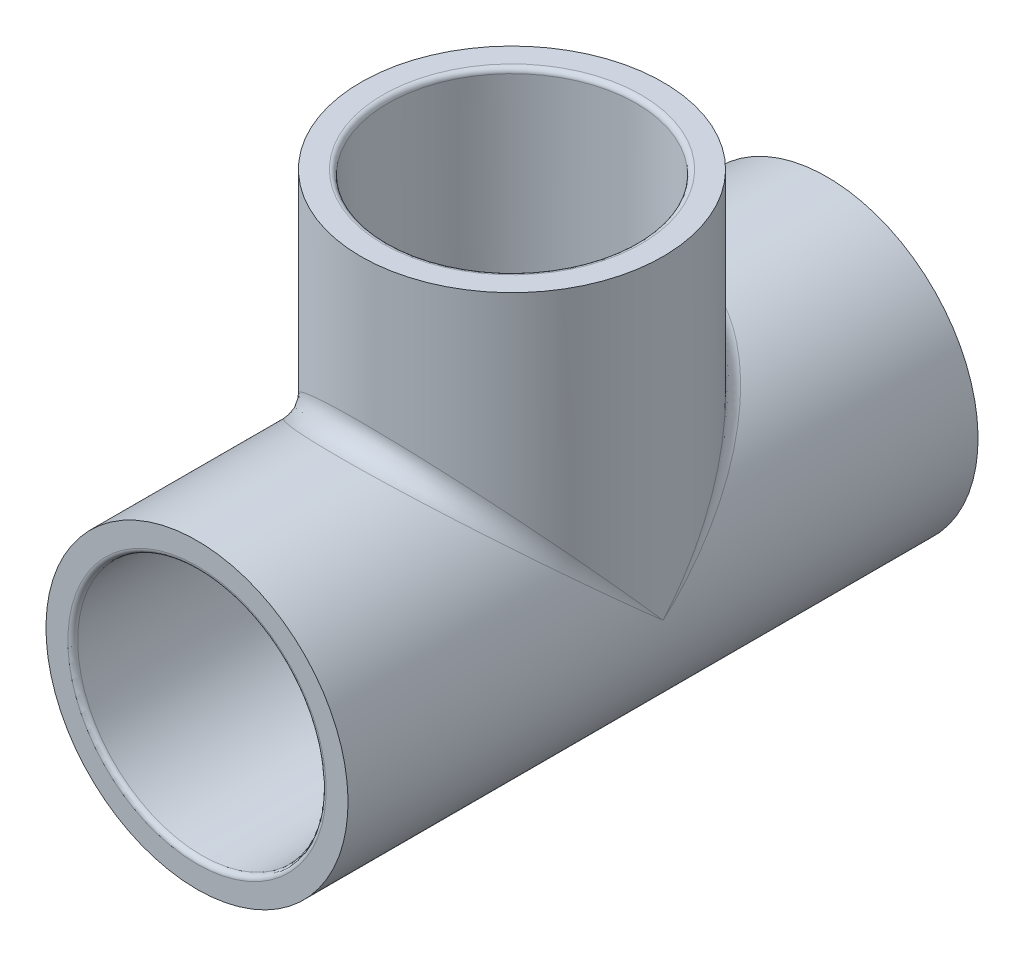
ISO-10303-21;
HEADER;
FILE_DESCRIPTION(('STEP AP214'),'2;1');
FILE_NAME('part.step','',(''),(''),'','','');
FILE_SCHEMA(('AUTOMOTIVE_DESIGN { 1 0 10303 214 1 1 1 1 }'));
ENDSEC;
DATA;
#1=APPLICATION_CONTEXT('core data for automotive mechanical design processes');
#2=APPLICATION_PROTOCOL_DEFINITION('international standard','automotive_design',2000,#1);
#3=PRODUCT_CONTEXT('',#1,'mechanical');
#4=PRODUCT('Part','Part','',(#3));
#5=PRODUCT_RELATED_PRODUCT_CATEGORY('part','',(#4));
#6=PRODUCT_DEFINITION_FORMATION('','',#4);
#7=PRODUCT_DEFINITION_CONTEXT('part definition',#1,'design');
#8=PRODUCT_DEFINITION('design','',#6,#7);
#9=PRODUCT_DEFINITION_SHAPE('','',#8);
#10=(LENGTH_UNIT() NAMED_UNIT(*) SI_UNIT(.MILLI.,.METRE.));
#11=(NAMED_UNIT(*) PLANE_ANGLE_UNIT() SI_UNIT($,.RADIAN.));
#12=(NAMED_UNIT(*) SI_UNIT($,.STERADIAN.) SOLID_ANGLE_UNIT());
#13=UNCERTAINTY_MEASURE_WITH_UNIT(LENGTH_MEASURE(1.E-05),#10,'distance_accuracy_value','');
#14=(GEOMETRIC_REPRESENTATION_CONTEXT(3) GLOBAL_UNCERTAINTY_ASSIGNED_CONTEXT((#13)) GLOBAL_UNIT_ASSIGNED_CONTEXT((#10,
#11,#12)) REPRESENTATION_CONTEXT('',''));
#15=CARTESIAN_POINT('',(0.,0.,0.));
#16=DIRECTION('',(0.,0.,1.));
#17=DIRECTION('',(1.,0.,0.));
#18=AXIS2_PLACEMENT_3D('',#15,#16,#17);
#19=CARTESIAN_POINT('',(0.,0.,42.672));
#20=DIRECTION('',(0.,0.,1.));
#21=DIRECTION('',(0.,-1.,0.));
#22=AXIS2_PLACEMENT_3D('',#19,#20,#21);
#23=CYLINDRICAL_SURFACE('',#22,20.4597);
#24=CARTESIAN_POINT('',(0.,0.,-42.672));
#25=DIRECTION('',(0.,0.,1.));
#26=DIRECTION('',(0.,-1.,0.));
#27=AXIS2_PLACEMENT_3D('',#24,#25,#26);
#28=CIRCLE('',#27,20.4597);
#29=CARTESIAN_POINT('',(0.,-20.4597,-42.672));
#30=VERTEX_POINT('',#29);
#31=EDGE_CURVE('E112',#30,#30,#28,.T.);
#32=ORIENTED_EDGE('',*,*,#31,.T.);
#33=EDGE_LOOP('',(#32));
#34=FACE_BOUND('',#33,.T.);
#35=CARTESIAN_POINT('',(0.,0.,42.672));
#36=DIRECTION('',(0.,0.,1.));
#37=DIRECTION('',(0.,-1.,0.));
#38=AXIS2_PLACEMENT_3D('',#35,#36,#37);
#39=CIRCLE('',#38,20.4597);
#40=CARTESIAN_POINT('',(0.,-20.4597,42.672));
#41=VERTEX_POINT('',#40);
#42=EDGE_CURVE('E115',#41,#41,#39,.T.);
#43=ORIENTED_EDGE('',*,*,#42,.F.);
#44=EDGE_LOOP('',(#43));
#45=FACE_BOUND('',#44,.T.);
#46=CARTESIAN_POINT('',(0.,0.,0.));
#47=DIRECTION('',(0.,0.750806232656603,-0.660522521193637));
#48=DIRECTION('',(0.,0.660522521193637,0.750806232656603));
#49=AXIS2_PLACEMENT_3D('',#46,#47,#48);
#50=ELLIPSE('',#49,30.9750225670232,20.4597);
#51=CARTESIAN_POINT('',(20.4597,0.,0.));
#52=VERTEX_POINT('',#51);
#53=CARTESIAN_POINT('',(-20.4597,0.,0.));
#54=VERTEX_POINT('',#53);
#55=EDGE_CURVE('E69',#52,#54,#50,.F.);
#56=ORIENTED_EDGE('',*,*,#55,.T.);
#57=CARTESIAN_POINT('',(0.,0.,0.));
#58=DIRECTION('',(0.,-0.750806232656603,-0.660522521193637));
#59=DIRECTION('',(0.,-0.660522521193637,0.750806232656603));
#60=AXIS2_PLACEMENT_3D('',#57,#58,#59);
#61=ELLIPSE('',#60,30.9750225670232,20.4597);
#62=EDGE_CURVE('E62',#54,#52,#61,.T.);
#63=ORIENTED_EDGE('',*,*,#62,.T.);
#64=EDGE_LOOP('',(#56,#63));
#65=FACE_BOUND('',#64,.T.);
#66=ADVANCED_FACE('F37',(#34,#45,#65),#23,.T.);
#67=CARTESIAN_POINT('',(0.,0.,42.672));
#68=DIRECTION('',(0.,0.,1.));
#69=DIRECTION('',(0.,-1.,0.));
#70=AXIS2_PLACEMENT_3D('',#67,#68,#69);
#71=PLANE('',#70);
#72=CARTESIAN_POINT('',(0.,0.,42.672));
#73=DIRECTION('',(0.,0.,1.));
#74=DIRECTION('',(0.,-1.,0.));
#75=AXIS2_PLACEMENT_3D('',#72,#73,#74);
#76=CIRCLE('',#75,17.4954157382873);
#77=CARTESIAN_POINT('',(0.,-17.4954157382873,42.672));
#78=VERTEX_POINT('',#77);
#79=EDGE_CURVE('E71',#78,#78,#76,.F.);
#80=ORIENTED_EDGE('',*,*,#79,.T.);
#81=EDGE_LOOP('',(#80));
#82=FACE_BOUND('',#81,.T.);
#83=ORIENTED_EDGE('',*,*,#42,.T.);
#84=EDGE_LOOP('',(#83));
#85=FACE_BOUND('',#84,.T.);
#86=ADVANCED_FACE('F95',(#82,#85),#71,.T.);
#87=CARTESIAN_POINT('',(0.,0.,-42.672));
#88=DIRECTION('',(0.,0.,-1.));
#89=DIRECTION('',(0.,1.,0.));
#90=AXIS2_PLACEMENT_3D('',#87,#88,#89);
#91=PLANE('',#90);
#92=CARTESIAN_POINT('',(0.,0.,-42.672));
#93=DIRECTION('',(0.,0.,-1.));
#94=DIRECTION('',(0.,1.,0.));
#95=AXIS2_PLACEMENT_3D('',#92,#93,#94);
#96=CIRCLE('',#95,17.4954157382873);
#97=CARTESIAN_POINT('',(0.,17.4954157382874,-42.672));
#98=VERTEX_POINT('',#97);
#99=EDGE_CURVE('E180',#98,#98,#96,.F.);
#100=ORIENTED_EDGE('',*,*,#99,.T.);
#101=EDGE_LOOP('',(#100));
#102=FACE_BOUND('',#101,.T.);
#103=ORIENTED_EDGE('',*,*,#31,.F.);
#104=EDGE_LOOP('',(#103));
#105=FACE_BOUND('',#104,.T.);
#106=ADVANCED_FACE('F91',(#102,#105),#91,.T.);
#107=CARTESIAN_POINT('',(0.,42.672,0.));
#108=DIRECTION('',(0.,1.,0.));
#109=DIRECTION('',(0.,0.,1.));
#110=AXIS2_PLACEMENT_3D('',#107,#108,#109);
#111=CYLINDRICAL_SURFACE('',#110,20.4597);
#112=CARTESIAN_POINT('',(0.,0.,0.));
#113=DIRECTION('',(0.,0.660522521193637,-0.750806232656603));
#114=DIRECTION('',(0.,0.750806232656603,0.660522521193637));
#115=AXIS2_PLACEMENT_3D('',#112,#113,#114);
#116=ELLIPSE('',#115,30.9750225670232,20.4597);
#117=EDGE_CURVE('E50',#54,#52,#116,.T.);
#118=ORIENTED_EDGE('',*,*,#117,.T.);
#119=CARTESIAN_POINT('',(0.,0.,0.));
#120=DIRECTION('',(0.,-0.660522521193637,-0.750806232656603));
#121=DIRECTION('',(0.,-0.750806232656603,0.660522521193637));
#122=AXIS2_PLACEMENT_3D('',#119,#120,#121);
#123=ELLIPSE('',#122,30.9750225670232,20.4597);
#124=EDGE_CURVE('E11',#52,#54,#123,.F.);
#125=ORIENTED_EDGE('',*,*,#124,.T.);
#126=EDGE_LOOP('',(#118,#125));
#127=FACE_BOUND('',#126,.T.);
#128=CARTESIAN_POINT('',(0.,42.672,0.));
#129=DIRECTION('',(0.,1.,0.));
#130=DIRECTION('',(0.,0.,1.));
#131=AXIS2_PLACEMENT_3D('',#128,#129,#130);
#132=CIRCLE('',#131,20.4597);
#133=CARTESIAN_POINT('',(0.,42.672,20.4597));
#134=VERTEX_POINT('',#133);
#135=EDGE_CURVE('E122',#134,#134,#132,.T.);
#136=ORIENTED_EDGE('',*,*,#135,.F.);
#137=EDGE_LOOP('',(#136));
#138=FACE_BOUND('',#137,.T.);
#139=ADVANCED_FACE('F65',(#127,#138),#111,.T.);
#140=CARTESIAN_POINT('',(0.,42.672,0.));
#141=DIRECTION('',(0.,-1.,0.));
#142=DIRECTION('',(0.,0.,-1.));
#143=AXIS2_PLACEMENT_3D('',#140,#141,#142);
#144=PLANE('',#143);
#145=CARTESIAN_POINT('',(0.,42.672,0.));
#146=DIRECTION('',(0.,-1.,0.));
#147=DIRECTION('',(0.,0.,-1.));
#148=AXIS2_PLACEMENT_3D('',#145,#146,#147);
#149=CIRCLE('',#148,17.4954157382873);
#150=CARTESIAN_POINT('',(0.,42.672,-17.4954157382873));
#151=VERTEX_POINT('',#150);
#152=EDGE_CURVE('E185',#151,#151,#149,.T.);
#153=ORIENTED_EDGE('',*,*,#152,.T.);
#154=EDGE_LOOP('',(#153));
#155=FACE_BOUND('',#154,.T.);
#156=ORIENTED_EDGE('',*,*,#135,.T.);
#157=EDGE_LOOP('',(#156));
#158=FACE_BOUND('',#157,.T.);
#159=ADVANCED_FACE('F90',(#155,#158),#144,.F.);
#160=CARTESIAN_POINT('',(0.,-16.637,18.034));
#161=DIRECTION('',(0.,0.,-1.));
#162=DIRECTION('',(0.,1.,0.));
#163=AXIS2_PLACEMENT_3D('',#160,#161,#162);
#164=PLANE('',#163);
#165=CARTESIAN_POINT('',(0.,0.,18.034));
#166=DIRECTION('',(0.,0.,-1.));
#167=DIRECTION('',(0.,1.,0.));
#168=AXIS2_PLACEMENT_3D('',#165,#166,#167);
#169=CIRCLE('',#168,16.1171599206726);
#170=CARTESIAN_POINT('',(0.,16.1171599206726,18.034));
#171=VERTEX_POINT('',#170);
#172=EDGE_CURVE('E171',#171,#171,#169,.F.);
#173=ORIENTED_EDGE('',*,*,#172,.T.);
#174=EDGE_LOOP('',(#173));
#175=FACE_BOUND('',#174,.T.);
#176=CARTESIAN_POINT('',(0.,0.,18.034));
#177=DIRECTION('',(0.,0.,1.));
#178=DIRECTION('',(0.,-1.,0.));
#179=AXIS2_PLACEMENT_3D('',#176,#177,#178);
#180=CIRCLE('',#179,15.7607);
#181=CARTESIAN_POINT('',(0.,-15.7607,18.034));
#182=VERTEX_POINT('',#181);
#183=EDGE_CURVE('E133',#182,#182,#180,.T.);
#184=ORIENTED_EDGE('',*,*,#183,.F.);
#185=EDGE_LOOP('',(#184));
#186=FACE_BOUND('',#185,.T.);
#187=ADVANCED_FACE('F229',(#175,#186),#164,.F.);
#188=CARTESIAN_POINT('',(0.,0.,42.672));
#189=DIRECTION('',(0.,0.,1.));
#190=DIRECTION('',(0.,-1.,0.));
#191=AXIS2_PLACEMENT_3D('',#188,#189,#190);
#192=CONICAL_SURFACE('',#191,16.8275,0.00773180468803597);
#193=CARTESIAN_POINT('',(0.,0.,42.004104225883));
#194=DIRECTION('',(0.,0.,1.));
#195=DIRECTION('',(0.,-1.,0.));
#196=AXIS2_PLACEMENT_3D('',#193,#194,#195);
#197=CIRCLE('',#196,16.8223358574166);
#198=CARTESIAN_POINT('',(0.,-16.8223358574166,42.004104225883));
#199=VERTEX_POINT('',#198);
#200=EDGE_CURVE('E74',#199,#199,#197,.T.);
#201=ORIENTED_EDGE('',*,*,#200,.T.);
#202=EDGE_LOOP('',(#201));
#203=FACE_BOUND('',#202,.T.);
#204=CARTESIAN_POINT('',(0.,0.,18.5538245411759));
#205=DIRECTION('',(0.,0.,1.));
#206=DIRECTION('',(0.,-1.,0.));
#207=AXIS2_PLACEMENT_3D('',#204,#205,#206);
#208=CIRCLE('',#207,16.6410192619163);
#209=CARTESIAN_POINT('',(0.,-16.6410192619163,18.5538245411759));
#210=VERTEX_POINT('',#209);
#211=EDGE_CURVE('E177',#210,#210,#208,.F.);
#212=ORIENTED_EDGE('',*,*,#211,.T.);
#213=EDGE_LOOP('',(#212));
#214=FACE_BOUND('',#213,.T.);
#215=ADVANCED_FACE('F191',(#203,#214),#192,.F.);
#216=CARTESIAN_POINT('',(0.,0.,-18.034));
#217=DIRECTION('',(0.,0.,-1.));
#218=DIRECTION('',(0.,1.,0.));
#219=AXIS2_PLACEMENT_3D('',#216,#217,#218);
#220=CONICAL_SURFACE('',#219,16.637,0.00773180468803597);
#221=CARTESIAN_POINT('',(0.,0.,-42.004104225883));
#222=DIRECTION('',(0.,0.,-1.));
#223=DIRECTION('',(0.,1.,0.));
#224=AXIS2_PLACEMENT_3D('',#221,#222,#223);
#225=CIRCLE('',#224,16.8223358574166);
#226=CARTESIAN_POINT('',(0.,16.8223358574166,-42.004104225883));
#227=VERTEX_POINT('',#226);
#228=EDGE_CURVE('E182',#227,#227,#225,.T.);
#229=ORIENTED_EDGE('',*,*,#228,.T.);
#230=EDGE_LOOP('',(#229));
#231=FACE_BOUND('',#230,.T.);
#232=CARTESIAN_POINT('',(0.,0.,-18.5538245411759));
#233=DIRECTION('',(0.,0.,-1.));
#234=DIRECTION('',(0.,1.,0.));
#235=AXIS2_PLACEMENT_3D('',#232,#233,#234);
#236=CIRCLE('',#235,16.6410192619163);
#237=CARTESIAN_POINT('',(0.,16.6410192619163,-18.5538245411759));
#238=VERTEX_POINT('',#237);
#239=EDGE_CURVE('E117',#238,#238,#236,.F.);
#240=ORIENTED_EDGE('',*,*,#239,.T.);
#241=EDGE_LOOP('',(#240));
#242=FACE_BOUND('',#241,.T.);
#243=ADVANCED_FACE('F240',(#231,#242),#220,.F.);
#244=CARTESIAN_POINT('',(0.,-16.637,-18.034));
#245=DIRECTION('',(0.,0.,1.));
#246=DIRECTION('',(0.,-1.,0.));
#247=AXIS2_PLACEMENT_3D('',#244,#245,#246);
#248=PLANE('',#247);
#249=CARTESIAN_POINT('',(0.,0.,-18.034));
#250=DIRECTION('',(0.,0.,1.));
#251=DIRECTION('',(0.,-1.,0.));
#252=AXIS2_PLACEMENT_3D('',#249,#250,#251);
#253=CIRCLE('',#252,16.1171599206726);
#254=CARTESIAN_POINT('',(0.,-16.1171599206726,-18.034));
#255=VERTEX_POINT('',#254);
#256=EDGE_CURVE('E120',#255,#255,#253,.F.);
#257=ORIENTED_EDGE('',*,*,#256,.T.);
#258=EDGE_LOOP('',(#257));
#259=FACE_BOUND('',#258,.T.);
#260=CARTESIAN_POINT('',(0.,0.,-18.034));
#261=DIRECTION('',(0.,0.,1.));
#262=DIRECTION('',(0.,-1.,0.));
#263=AXIS2_PLACEMENT_3D('',#260,#261,#262);
#264=CIRCLE('',#263,15.7607);
#265=CARTESIAN_POINT('',(0.,-15.7607,-18.034));
#266=VERTEX_POINT('',#265);
#267=EDGE_CURVE('E224',#266,#266,#264,.T.);
#268=ORIENTED_EDGE('',*,*,#267,.T.);
#269=EDGE_LOOP('',(#268));
#270=FACE_BOUND('',#269,.T.);
#271=ADVANCED_FACE('F244',(#259,#270),#248,.F.);
#272=CARTESIAN_POINT('',(0.,0.,42.672));
#273=DIRECTION('',(0.,0.,1.));
#274=DIRECTION('',(0.,-1.,0.));
#275=AXIS2_PLACEMENT_3D('',#272,#273,#274);
#276=CYLINDRICAL_SURFACE('',#275,15.7607);
#277=CARTESIAN_POINT('',(0.,15.7607,-14.5415));
#278=CARTESIAN_POINT('',(-0.334118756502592,15.7606966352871,-14.5414965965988));
#279=CARTESIAN_POINT('',(-0.668298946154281,15.7500515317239,-14.5299608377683));
#280=CARTESIAN_POINT('',(-1.3337810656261,15.7077032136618,-14.4840455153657));
#281=CARTESIAN_POINT('',(-1.66508226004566,15.6759947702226,-14.4496602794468));
#282=CARTESIAN_POINT('',(-2.32232894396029,15.5921872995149,-14.3586968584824));
#283=CARTESIAN_POINT('',(-2.64826890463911,15.5400684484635,-14.3020970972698));
#284=CARTESIAN_POINT('',(-3.29199469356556,15.4165451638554,-14.1677844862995));
#285=CARTESIAN_POINT('',(-3.60978082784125,15.3451414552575,-14.0900724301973));
#286=CARTESIAN_POINT('',(-4.2330937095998,15.18497451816,-13.9154665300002));
#287=CARTESIAN_POINT('',(-4.53868804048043,15.0963301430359,-13.8187039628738));
#288=CARTESIAN_POINT('',(-5.13826875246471,14.9029226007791,-13.6071487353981));
#289=CARTESIAN_POINT('',(-5.43225527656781,14.7981596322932,-13.4923562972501));
#290=CARTESIAN_POINT('',(-6.00750379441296,14.5741159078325,-13.2462450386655));
#291=CARTESIAN_POINT('',(-6.28876457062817,14.4548337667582,-13.1149246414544));
#292=CARTESIAN_POINT('',(-6.83778900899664,14.2033631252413,-12.8372328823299));
#293=CARTESIAN_POINT('',(-7.10554958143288,14.0711716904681,-12.6908580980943));
#294=CARTESIAN_POINT('',(-7.73209513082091,13.7399238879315,-12.32273834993));
#295=CARTESIAN_POINT('',(-8.08411652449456,13.5353772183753,-12.094378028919));
#296=CARTESIAN_POINT('',(-8.7600106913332,13.1080842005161,-11.6141914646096));
#297=CARTESIAN_POINT('',(-9.08387293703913,12.885331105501,-11.362356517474));
#298=CARTESIAN_POINT('',(-9.70402195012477,12.425015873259,-10.8375510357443));
#299=CARTESIAN_POINT('',(-10.0002524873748,12.1874251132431,-10.5645393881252));
#300=CARTESIAN_POINT('',(-10.5647492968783,11.7014710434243,-10.0000318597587));
#301=CARTESIAN_POINT('',(-10.8330190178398,11.4531090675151,-9.70853826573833));
#302=CARTESIAN_POINT('',(-11.3484561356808,10.9428926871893,-9.10111734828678));
#303=CARTESIAN_POINT('',(-11.5949413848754,10.6808566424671,-8.78476515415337));
#304=CARTESIAN_POINT('',(-12.0598036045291,10.1530507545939,-8.13486629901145));
#305=CARTESIAN_POINT('',(-12.2781744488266,9.88728011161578,-7.80131591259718));
#306=CARTESIAN_POINT('',(-12.6867853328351,9.35718510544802,-7.11752025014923));
#307=CARTESIAN_POINT('',(-12.8770756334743,9.09285899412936,-6.76730632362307));
#308=CARTESIAN_POINT('',(-13.2300050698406,8.57120043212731,-6.04835698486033));
#309=CARTESIAN_POINT('',(-13.3926581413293,8.313864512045,-5.67963102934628));
#310=CARTESIAN_POINT('',(-13.6134028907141,7.94323481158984,-5.11562749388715));
#311=CARTESIAN_POINT('',(-13.6822914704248,7.82384309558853,-4.9285324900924));
#312=CARTESIAN_POINT('',(-13.8131980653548,7.59032938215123,-4.54875320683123));
#313=CARTESIAN_POINT('',(-13.8752172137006,7.47620651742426,-4.3560698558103));
#314=CARTESIAN_POINT('',(-13.9921545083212,7.2549934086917,-3.96441584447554));
#315=CARTESIAN_POINT('',(-14.0470691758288,7.14790662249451,-3.76544216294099));
#316=CARTESIAN_POINT('',(-14.149333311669,6.94328015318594,-3.36083146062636));
#317=CARTESIAN_POINT('',(-14.1966836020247,6.84573943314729,-3.15519516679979));
#318=CARTESIAN_POINT('',(-14.3126285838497,6.60127997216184,-2.59465479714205));
#319=CARTESIAN_POINT('',(-14.3739132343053,6.46561970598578,-2.23291685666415));
#320=CARTESIAN_POINT('',(-14.4457463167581,6.30267170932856,-1.67646368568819));
#321=CARTESIAN_POINT('',(-14.4663291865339,6.25514510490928,-1.48890142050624));
#322=CARTESIAN_POINT('',(-14.5003363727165,6.17590249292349,-1.10978582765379));
#323=CARTESIAN_POINT('',(-14.5137627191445,6.1441820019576,-0.918233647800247));
#324=CARTESIAN_POINT('',(-14.5316053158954,6.10184867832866,-0.561052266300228));
#325=CARTESIAN_POINT('',(-14.537057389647,6.0888150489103,-0.395760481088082));
#326=CARTESIAN_POINT('',(-14.5422991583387,6.07628588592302,-0.0645782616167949));
#327=CARTESIAN_POINT('',(-14.5420894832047,6.07678884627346,0.10131210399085));
#328=CARTESIAN_POINT('',(-14.5360125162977,6.09131051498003,0.432422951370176));
#329=CARTESIAN_POINT('',(-14.5301440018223,6.1053321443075,0.597643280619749));
#330=CARTESIAN_POINT('',(-14.5129038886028,6.14619948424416,0.92625247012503));
#331=CARTESIAN_POINT('',(-14.5015295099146,6.17305167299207,1.0896403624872));
#332=CARTESIAN_POINT('',(-14.4689687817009,6.24906663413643,1.46651423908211));
#333=CARTESIAN_POINT('',(-14.4457912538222,6.30265151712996,1.67893725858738));
#334=CARTESIAN_POINT('',(-14.3909614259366,6.42685565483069,2.09764638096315));
#335=CARTESIAN_POINT('',(-14.3593034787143,6.4974862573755,2.30392829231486));
#336=CARTESIAN_POINT('',(-14.2881145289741,6.65257456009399,2.71068347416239));
#337=CARTESIAN_POINT('',(-14.2485538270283,6.73708419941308,2.91113146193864));
#338=CARTESIAN_POINT('',(-14.162248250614,6.91666925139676,3.30555690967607));
#339=CARTESIAN_POINT('',(-14.115504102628,7.01174359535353,3.4995350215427));
#340=CARTESIAN_POINT('',(-14.0153935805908,7.20976313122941,3.88108044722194));
#341=CARTESIAN_POINT('',(-13.9620417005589,7.31269091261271,4.06866068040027));
#342=CARTESIAN_POINT('',(-13.8489522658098,7.52466978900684,4.43836603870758));
#343=CARTESIAN_POINT('',(-13.7892135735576,7.63372197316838,4.6204901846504));
#344=CARTESIAN_POINT('',(-13.600676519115,7.96783959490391,5.15965926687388));
#345=CARTESIAN_POINT('',(-13.462619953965,8.19973900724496,5.50926518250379));
#346=CARTESIAN_POINT('',(-13.162616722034,8.67318103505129,6.19191684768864));
#347=CARTESIAN_POINT('',(-13.0006352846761,8.91473730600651,6.52493753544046));
#348=CARTESIAN_POINT('',(-12.6531730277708,9.40139703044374,7.1755372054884));
#349=CARTESIAN_POINT('',(-12.4677008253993,9.64649915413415,7.49312179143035));
#350=CARTESIAN_POINT('',(-12.0469446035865,10.1684586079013,8.15473474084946));
#351=CARTESIAN_POINT('',(-11.8083169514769,10.4452312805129,8.49671018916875));
#352=CARTESIAN_POINT('',(-11.3000409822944,10.9931094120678,9.16184814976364));
#353=CARTESIAN_POINT('',(-11.0303855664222,11.264213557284,9.48500633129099));
#354=CARTESIAN_POINT('',(-10.4599022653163,11.7958425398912,10.1106161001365));
#355=CARTESIAN_POINT('',(-10.1591282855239,12.0563846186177,10.4131020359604));
#356=CARTESIAN_POINT('',(-9.52549026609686,12.5630071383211,10.9956971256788));
#357=CARTESIAN_POINT('',(-9.1926368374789,12.8090923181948,11.275813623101));
#358=CARTESIAN_POINT('',(-8.57668955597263,13.2266430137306,11.7477097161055));
#359=CARTESIAN_POINT('',(-8.30030048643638,13.402047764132,11.9447723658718));
#360=CARTESIAN_POINT('',(-7.72874257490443,13.7395888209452,12.3222972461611));
#361=CARTESIAN_POINT('',(-7.43357783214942,13.9017280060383,12.5027630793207));
#362=CARTESIAN_POINT('',(-6.82510140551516,14.2103463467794,12.8450367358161));
#363=CARTESIAN_POINT('',(-6.51180304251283,14.356836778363,13.0068580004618));
#364=CARTESIAN_POINT('',(-5.86777629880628,14.6318622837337,13.3098079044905));
#365=CARTESIAN_POINT('',(-5.53705065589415,14.760400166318,13.4509397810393));
#366=CARTESIAN_POINT('',(-4.9130173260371,14.9784283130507,13.6898085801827));
#367=CARTESIAN_POINT('',(-4.62201790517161,15.0708800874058,13.7908792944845));
#368=CARTESIAN_POINT('',(-4.02999143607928,15.2398670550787,13.9753524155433));
#369=CARTESIAN_POINT('',(-3.72896636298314,15.3164053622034,14.0587582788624));
#370=CARTESIAN_POINT('',(-3.11859988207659,15.452239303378,14.2066220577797));
#371=CARTESIAN_POINT('',(-2.80926194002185,15.5115420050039,14.2710877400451));
#372=CARTESIAN_POINT('',(-2.18413690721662,15.6118354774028,14.3800353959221));
#373=CARTESIAN_POINT('',(-1.86834975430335,15.6528260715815,14.4245171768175));
#374=CARTESIAN_POINT('',(-1.23136293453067,15.7157958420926,14.4928248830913));
#375=CARTESIAN_POINT('',(-0.910146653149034,15.7376982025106,14.5165673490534));
#376=CARTESIAN_POINT('',(-0.266102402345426,15.7617477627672,14.5426364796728));
#377=CARTESIAN_POINT('',(0.0567255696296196,15.7638949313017,14.5449631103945));
#378=CARTESIAN_POINT('',(0.701341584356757,15.7483882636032,14.5281554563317));
#379=CARTESIAN_POINT('',(1.02312962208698,15.7307343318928,14.5090210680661));
#380=CARTESIAN_POINT('',(1.66307086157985,15.6760003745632,14.4496601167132));
#381=CARTESIAN_POINT('',(1.98122414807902,15.6389208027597,14.4094340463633));
#382=CARTESIAN_POINT('',(2.59172588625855,15.5490124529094,14.3118022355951));
#383=CARTESIAN_POINT('',(2.88444150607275,15.4973169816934,14.2556318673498));
#384=CARTESIAN_POINT('',(3.46283773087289,15.3784130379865,14.1262802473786));
#385=CARTESIAN_POINT('',(3.74851884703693,15.3112056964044,14.0531002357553));
#386=CARTESIAN_POINT('',(4.31145836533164,15.1623143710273,13.890730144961));
#387=CARTESIAN_POINT('',(4.58871553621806,15.0806282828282,13.8015377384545));
#388=CARTESIAN_POINT('',(5.13364619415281,14.9039400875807,13.6082519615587));
#389=CARTESIAN_POINT('',(5.40131779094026,14.8089353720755,13.5041556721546));
#390=CARTESIAN_POINT('',(6.01884123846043,14.5711335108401,13.2430113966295));
#391=CARTESIAN_POINT('',(6.36435358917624,14.423303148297,13.0802418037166));
#392=CARTESIAN_POINT('',(7.03473343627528,14.1084883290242,12.7322620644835));
#393=CARTESIAN_POINT('',(7.3595949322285,13.9414983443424,12.5470454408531));
#394=CARTESIAN_POINT('',(7.98841408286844,13.5909784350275,12.156385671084));
#395=CARTESIAN_POINT('',(8.29233353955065,13.4074196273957,11.9509071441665));
#396=CARTESIAN_POINT('',(8.87833479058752,13.0267780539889,11.5222485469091));
#397=CARTESIAN_POINT('',(9.1604162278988,12.8296950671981,11.2990681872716));
#398=CARTESIAN_POINT('',(9.79270544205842,12.3574125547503,10.7602614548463));
#399=CARTESIAN_POINT('',(10.1345293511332,12.0779616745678,10.4385006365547));
#400=CARTESIAN_POINT('',(10.7803418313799,11.5052277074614,9.7701374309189));
#401=CARTESIAN_POINT('',(11.0843136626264,11.2119385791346,9.42352415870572));
#402=CARTESIAN_POINT('',(11.6553088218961,10.6171298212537,8.70740130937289));
#403=CARTESIAN_POINT('',(11.9223153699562,10.3156065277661,8.33788144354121));
#404=CARTESIAN_POINT('',(12.4199229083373,9.71072847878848,7.5767760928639));
#405=CARTESIAN_POINT('',(12.6505393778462,9.4073745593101,7.18520008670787));
#406=CARTESIAN_POINT('',(12.9928520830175,8.92389828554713,6.53591938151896));
#407=CARTESIAN_POINT('',(13.115856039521,8.74184534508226,6.28554783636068));
#408=CARTESIAN_POINT('',(13.3483838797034,8.38248423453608,5.77533498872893));
#409=CARTESIAN_POINT('',(13.4579100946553,8.2051752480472,5.51549533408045));
#410=CARTESIAN_POINT('',(13.6630991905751,7.85874436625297,4.98554006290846));
#411=CARTESIAN_POINT('',(13.7587778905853,7.68961327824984,4.71543662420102));
#412=CARTESIAN_POINT('',(13.9358100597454,7.36390645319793,4.16322809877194));
#413=CARTESIAN_POINT('',(14.0171699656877,7.20732509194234,3.88112847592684));
#414=CARTESIAN_POINT('',(14.1354775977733,6.97122208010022,3.41703391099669));
#415=CARTESIAN_POINT('',(14.1772976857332,6.88563667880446,3.23936523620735));
#416=CARTESIAN_POINT('',(14.2549273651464,6.72344986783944,2.87859746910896));
#417=CARTESIAN_POINT('',(14.2907357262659,6.64685029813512,2.69549727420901));
#418=CARTESIAN_POINT('',(14.3558008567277,6.50513053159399,2.32414723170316));
#419=CARTESIAN_POINT('',(14.3850703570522,6.43998808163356,2.13590820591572));
#420=CARTESIAN_POINT('',(14.4365755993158,6.32368624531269,1.75428631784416));
#421=CARTESIAN_POINT('',(14.4588163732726,6.2725168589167,1.56090724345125));
#422=CARTESIAN_POINT('',(14.4923274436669,6.19464005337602,1.20558002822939));
#423=CARTESIAN_POINT('',(14.5048607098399,6.16516931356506,1.04435879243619));
#424=CARTESIAN_POINT('',(14.5245794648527,6.11857039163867,0.719866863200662));
#425=CARTESIAN_POINT('',(14.5317675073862,6.10143631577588,0.556597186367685));
#426=CARTESIAN_POINT('',(14.5406155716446,6.0803205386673,0.229170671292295));
#427=CARTESIAN_POINT('',(14.5422796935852,6.076329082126,0.0650145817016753));
#428=CARTESIAN_POINT('',(14.5400460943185,6.08167177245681,-0.263044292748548));
#429=CARTESIAN_POINT('',(14.5361481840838,6.09100637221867,-0.426947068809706));
#430=CARTESIAN_POINT('',(14.5229195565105,6.12247961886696,-0.752659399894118));
#431=CARTESIAN_POINT('',(14.5136093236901,6.14456998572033,-0.9144745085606));
#432=CARTESIAN_POINT('',(14.4897982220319,6.2005103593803,-1.23569752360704));
#433=CARTESIAN_POINT('',(14.475295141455,6.23436537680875,-1.39510437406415));
#434=CARTESIAN_POINT('',(14.4243867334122,6.35169297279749,-1.86901531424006));
#435=CARTESIAN_POINT('',(14.3805962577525,6.45089240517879,-2.17888740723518));
#436=CARTESIAN_POINT('',(14.2780899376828,6.67459425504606,-2.77093439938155));
#437=CARTESIAN_POINT('',(14.2200809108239,6.79785406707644,-3.0537262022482));
#438=CARTESIAN_POINT('',(14.0899330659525,7.06366701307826,-3.60690421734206));
#439=CARTESIAN_POINT('',(14.0177807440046,7.20623854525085,-3.87727826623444));
#440=CARTESIAN_POINT('',(13.8601351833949,7.50499737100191,-4.40781038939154));
#441=CARTESIAN_POINT('',(13.7745876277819,7.66123890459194,-4.66792122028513));
#442=CARTESIAN_POINT('',(13.5910318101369,7.98233903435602,-5.17808110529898));
#443=CARTESIAN_POINT('',(13.4930265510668,8.1471955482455,-5.42813256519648));
#444=CARTESIAN_POINT('',(13.2935351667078,8.46843068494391,-5.89889244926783));
#445=CARTESIAN_POINT('',(13.1930169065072,8.62437364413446,-6.12031139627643));
#446=CARTESIAN_POINT('',(12.9818800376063,8.93903798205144,-6.55626775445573));
#447=CARTESIAN_POINT('',(12.8712601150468,9.0977597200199,-6.77080426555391));
#448=CARTESIAN_POINT('',(12.5241569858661,9.57601985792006,-7.4049524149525));
#449=CARTESIAN_POINT('',(12.2725092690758,9.89752370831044,-7.8149175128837));
#450=CARTESIAN_POINT('',(11.728818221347,10.5361479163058,-8.609368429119));
#451=CARTESIAN_POINT('',(11.4368362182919,10.85327413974,-8.99389164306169));
#452=CARTESIAN_POINT('',(10.8112684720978,11.4765376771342,-9.73690457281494));
#453=CARTESIAN_POINT('',(10.4777064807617,11.7826811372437,-10.0954089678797));
#454=CARTESIAN_POINT('',(9.86353672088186,12.2973513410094,-10.6909438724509));
#455=CARTESIAN_POINT('',(9.5928435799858,12.5099722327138,-10.9346964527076));
#456=CARTESIAN_POINT('',(9.02839471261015,12.923237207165,-11.4051865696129));
#457=CARTESIAN_POINT('',(8.73463933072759,13.1238814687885,-11.6319243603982));
#458=CARTESIAN_POINT('',(8.12443254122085,13.5101259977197,-12.0660203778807));
#459=CARTESIAN_POINT('',(7.80800817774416,13.6957436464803,-12.273401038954));
#460=CARTESIAN_POINT('',(7.15257667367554,14.0491578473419,-12.666562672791));
#461=CARTESIAN_POINT('',(6.81357479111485,14.2169585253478,-12.8523486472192));
#462=CARTESIAN_POINT('',(6.18296984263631,14.5005306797,-13.1652729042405));
#463=CARTESIAN_POINT('',(5.89519516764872,14.6200381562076,-13.2967529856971));
#464=CARTESIAN_POINT('',(5.30663583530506,14.8437979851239,-13.5423951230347));
#465=CARTESIAN_POINT('',(5.00585394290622,14.9480535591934,-13.6565608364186));
#466=CARTESIAN_POINT('',(4.39291451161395,15.1395154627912,-13.8658671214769));
#467=CARTESIAN_POINT('',(4.08077201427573,15.2267434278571,-13.9610318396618));
#468=CARTESIAN_POINT('',(3.44649554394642,15.3827142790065,-14.1309800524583));
#469=CARTESIAN_POINT('',(3.12436412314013,15.451461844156,-14.2057687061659));
#470=CARTESIAN_POINT('',(2.57041667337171,15.5514091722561,-14.3144049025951));
#471=CARTESIAN_POINT('',(2.34057962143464,15.5876830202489,-14.35380063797));
#472=CARTESIAN_POINT('',(1.87794581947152,15.6501578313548,-14.4216217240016));
#473=CARTESIAN_POINT('',(1.64514942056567,15.6763599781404,-14.4500483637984));
#474=CARTESIAN_POINT('',(1.177456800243,15.7184095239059,-14.495655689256));
#475=CARTESIAN_POINT('',(0.942560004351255,15.7342539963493,-14.5128331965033));
#476=CARTESIAN_POINT('',(0.471785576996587,15.7553996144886,-14.535755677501));
#477=CARTESIAN_POINT('',(0.235908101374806,15.7607023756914,-14.5415024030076));
#478=CARTESIAN_POINT('',(0.,15.7607,-14.5415));
#479=B_SPLINE_CURVE_WITH_KNOTS('',3,(#277,#278,#279,#280,#281,#282,#283,#284,#285,#286,#287,
#288,#289,#290,#291,#292,#293,#294,#295,#296,#297,#298,#299,#300,#301,#302,#303,#304,#305,#306,
#307,#308,#309,#310,#311,#312,#313,#314,#315,#316,#317,#318,#319,#320,#321,#322,#323,#324,#325,
#326,#327,#328,#329,#330,#331,#332,#333,#334,#335,#336,#337,#338,#339,#340,#341,#342,#343,#344,
#345,#346,#347,#348,#349,#350,#351,#352,#353,#354,#355,#356,#357,#358,#359,#360,#361,#362,#363,
#364,#365,#366,#367,#368,#369,#370,#371,#372,#373,#374,#375,#376,#377,#378,#379,#380,#381,#382,
#383,#384,#385,#386,#387,#388,#389,#390,#391,#392,#393,#394,#395,#396,#397,#398,#399,#400,#401,
#402,#403,#404,#405,#406,#407,#408,#409,#410,#411,#412,#413,#414,#415,#416,#417,#418,#419,#420,
#421,#422,#423,#424,#425,#426,#427,#428,#429,#430,#431,#432,#433,#434,#435,#436,#437,#438,#439,
#440,#441,#442,#443,#444,#445,#446,#447,#448,#449,#450,#451,#452,#453,#454,#455,#456,#457,#458,
#459,#460,#461,#462,#463,#464,#465,#466,#467,#468,#469,#470,#471,#472,#473,#474,#475,#476,#477,
#478),.UNSPECIFIED.,.T.,.F.,(4,2,2,2,2,2,2,2,2,2,2,2,2,2,2,2,2,2,2,2,2,2,2,2,2,2,2,2,2,2,2,2,2,
2,2,2,2,2,2,2,2,2,2,2,2,2,2,2,2,2,2,2,2,2,2,2,2,2,2,2,2,2,2,2,2,2,2,2,2,2,2,2,2,2,2,2,2,2,2,2,2,
2,2,2,2,2,2,2,2,2,2,2,2,2,2,2,2,2,2,2,4),(0.,1.00209816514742,2.00444519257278,3.00776818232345,
4.01105346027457,5.0076529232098,6.00424010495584,7.00092243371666,7.99783184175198,
9.39617350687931,10.7950357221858,12.1966851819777,13.5981615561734,15.0341422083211,
16.4704352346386,17.904125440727,19.3370905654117,20.0340757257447,20.730945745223,
21.428155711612,22.1252898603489,23.2942291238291,23.8773219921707,24.4602493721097,
24.9573171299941,25.4543295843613,25.9514494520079,26.4488205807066,27.1086051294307,
27.7688301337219,28.4315846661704,29.0942722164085,29.7555310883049,30.4169079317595,
31.7404838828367,33.0660026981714,34.3910366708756,35.8912034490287,37.3917141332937,
38.8896677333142,40.3871275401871,41.5324534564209,42.6775301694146,43.8217761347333,
44.9658428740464,45.9297614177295,46.8934911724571,47.8568251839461,48.820168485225,
49.7873708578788,50.7545747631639,51.7217833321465,52.6889693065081,53.5955098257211,
54.5019842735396,55.408590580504,56.3153746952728,57.5422097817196,58.7693997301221,
59.9987718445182,61.2281640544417,62.8647809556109,64.5021190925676,66.1401980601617,
67.7775783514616,68.7765306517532,69.7753099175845,70.772939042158,71.7701185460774,
72.3746094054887,72.9792238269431,73.5826506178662,74.1856444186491,74.6782490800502,
75.1706182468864,75.6626218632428,76.1546422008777,76.6448123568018,77.1351915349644,
78.1169136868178,79.0572607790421,79.998510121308,80.9436800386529,81.8886225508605,
82.7549534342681,83.6213971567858,85.3550002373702,87.0859958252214,88.8160071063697,
90.0803386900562,91.3446513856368,92.6074800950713,93.8700157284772,94.8836907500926,
95.8971513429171,96.9093157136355,97.9212235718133,98.628757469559,99.3362081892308,
100.043858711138,100.751400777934),.UNSPECIFIED.);
#480=CARTESIAN_POINT('',(0.,15.7607,-14.5415));
#481=VERTEX_POINT('',#480);
#482=EDGE_CURVE('E126',#481,#481,#479,.T.);
#483=ORIENTED_EDGE('',*,*,#482,.T.);
#484=EDGE_LOOP('',(#483));
#485=FACE_BOUND('',#484,.T.);
#486=ORIENTED_EDGE('',*,*,#267,.F.);
#487=EDGE_LOOP('',(#486));
#488=FACE_BOUND('',#487,.T.);
#489=ORIENTED_EDGE('',*,*,#183,.T.);
#490=EDGE_LOOP('',(#489));
#491=FACE_BOUND('',#490,.T.);
#492=ADVANCED_FACE('F136',(#485,#488,#491),#276,.F.);
#493=CARTESIAN_POINT('',(0.,0.,0.));
#494=DIRECTION('',(0.,-1.,0.));
#495=DIRECTION('',(0.,0.,-1.));
#496=AXIS2_PLACEMENT_3D('',#493,#494,#495);
#497=CYLINDRICAL_SURFACE('',#496,14.5415);
#498=CARTESIAN_POINT('',(0.,18.034,0.));
#499=DIRECTION('',(0.,-1.,0.));
#500=DIRECTION('',(0.,0.,-1.));
#501=AXIS2_PLACEMENT_3D('',#498,#499,#500);
#502=CIRCLE('',#501,14.5415);
#503=CARTESIAN_POINT('',(0.,18.034,-14.5415));
#504=VERTEX_POINT('',#503);
#505=EDGE_CURVE('E134',#504,#504,#502,.T.);
#506=ORIENTED_EDGE('',*,*,#505,.F.);
#507=EDGE_LOOP('',(#506));
#508=FACE_BOUND('',#507,.T.);
#509=ORIENTED_EDGE('',*,*,#482,.F.);
#510=EDGE_LOOP('',(#509));
#511=FACE_BOUND('',#510,.T.);
#512=ADVANCED_FACE('F139',(#508,#511),#497,.F.);
#513=CARTESIAN_POINT('',(0.,18.034,-14.5415));
#514=DIRECTION('',(0.,-1.,0.));
#515=DIRECTION('',(0.,0.,-1.));
#516=AXIS2_PLACEMENT_3D('',#513,#514,#515);
#517=PLANE('',#516);
#518=CARTESIAN_POINT('',(0.,18.034,0.));
#519=DIRECTION('',(0.,-1.,0.));
#520=DIRECTION('',(0.,0.,-1.));
#521=AXIS2_PLACEMENT_3D('',#518,#519,#520);
#522=CIRCLE('',#521,16.1171599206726);
#523=CARTESIAN_POINT('',(0.,18.034,-16.1171599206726));
#524=VERTEX_POINT('',#523);
#525=EDGE_CURVE('E168',#524,#524,#522,.F.);
#526=ORIENTED_EDGE('',*,*,#525,.T.);
#527=EDGE_LOOP('',(#526));
#528=FACE_BOUND('',#527,.T.);
#529=ORIENTED_EDGE('',*,*,#505,.T.);
#530=EDGE_LOOP('',(#529));
#531=FACE_BOUND('',#530,.T.);
#532=ADVANCED_FACE('F143',(#528,#531),#517,.F.);
#533=CARTESIAN_POINT('',(0.,18.034,0.));
#534=DIRECTION('',(0.,1.,0.));
#535=DIRECTION('',(0.,0.,1.));
#536=AXIS2_PLACEMENT_3D('',#533,#534,#535);
#537=CONICAL_SURFACE('',#536,16.637,0.00773180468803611);
#538=CARTESIAN_POINT('',(0.,42.004104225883,0.));
#539=DIRECTION('',(0.,-1.,0.));
#540=DIRECTION('',(0.,0.,-1.));
#541=AXIS2_PLACEMENT_3D('',#538,#539,#540);
#542=CIRCLE('',#541,16.8223358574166);
#543=CARTESIAN_POINT('',(0.,42.004104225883,-16.8223358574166));
#544=VERTEX_POINT('',#543);
#545=EDGE_CURVE('E163',#544,#544,#542,.F.);
#546=ORIENTED_EDGE('',*,*,#545,.T.);
#547=EDGE_LOOP('',(#546));
#548=FACE_BOUND('',#547,.T.);
#549=CARTESIAN_POINT('',(0.,18.5538245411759,0.));
#550=DIRECTION('',(0.,1.,0.));
#551=DIRECTION('',(0.,0.,1.));
#552=AXIS2_PLACEMENT_3D('',#549,#550,#551);
#553=CIRCLE('',#552,16.6410192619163);
#554=CARTESIAN_POINT('',(0.,18.5538245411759,16.6410192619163));
#555=VERTEX_POINT('',#554);
#556=EDGE_CURVE('E166',#555,#555,#553,.F.);
#557=ORIENTED_EDGE('',*,*,#556,.T.);
#558=EDGE_LOOP('',(#557));
#559=FACE_BOUND('',#558,.T.);
#560=ADVANCED_FACE('F147',(#548,#559),#537,.F.);
#561=CARTESIAN_POINT('',(0.,0.,-18.557875));
#562=DIRECTION('',(0.,0.,1.));
#563=DIRECTION('',(0.,-1.,0.));
#564=AXIS2_PLACEMENT_3D('',#561,#562,#563);
#565=TOROIDAL_SURFACE('',#564,16.1171599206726,0.523875);
#566=ORIENTED_EDGE('',*,*,#256,.F.);
#567=EDGE_LOOP('',(#566));
#568=FACE_BOUND('',#567,.T.);
#569=ORIENTED_EDGE('',*,*,#239,.F.);
#570=EDGE_LOOP('',(#569));
#571=FACE_BOUND('',#570,.T.);
#572=ADVANCED_FACE('F150',(#568,#571),#565,.F.);
#573=CARTESIAN_POINT('',(0.,18.557875,0.));
#574=DIRECTION('',(0.,-1.,0.));
#575=DIRECTION('',(0.,0.,-1.));
#576=AXIS2_PLACEMENT_3D('',#573,#574,#575);
#577=TOROIDAL_SURFACE('',#576,16.1171599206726,0.523875);
#578=ORIENTED_EDGE('',*,*,#525,.F.);
#579=EDGE_LOOP('',(#578));
#580=FACE_BOUND('',#579,.T.);
#581=ORIENTED_EDGE('',*,*,#556,.F.);
#582=EDGE_LOOP('',(#581));
#583=FACE_BOUND('',#582,.T.);
#584=ADVANCED_FACE('F157',(#580,#583),#577,.F.);
#585=CARTESIAN_POINT('',(0.,0.,18.557875));
#586=DIRECTION('',(0.,0.,-1.));
#587=DIRECTION('',(0.,1.,0.));
#588=AXIS2_PLACEMENT_3D('',#585,#586,#587);
#589=TOROIDAL_SURFACE('',#588,16.1171599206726,0.523875);
#590=ORIENTED_EDGE('',*,*,#211,.F.);
#591=EDGE_LOOP('',(#590));
#592=FACE_BOUND('',#591,.T.);
#593=ORIENTED_EDGE('',*,*,#172,.F.);
#594=EDGE_LOOP('',(#593));
#595=FACE_BOUND('',#594,.T.);
#596=ADVANCED_FACE('F204',(#592,#595),#589,.F.);
#597=CARTESIAN_POINT('',(0.,0.,-41.9989));
#598=DIRECTION('',(0.,0.,-1.));
#599=DIRECTION('',(0.,1.,0.));
#600=AXIS2_PLACEMENT_3D('',#597,#598,#599);
#601=TOROIDAL_SURFACE('',#600,17.4954157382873,0.6731);
#602=ORIENTED_EDGE('',*,*,#228,.F.);
#603=EDGE_LOOP('',(#602));
#604=FACE_BOUND('',#603,.T.);
#605=ORIENTED_EDGE('',*,*,#99,.F.);
#606=EDGE_LOOP('',(#605));
#607=FACE_BOUND('',#606,.T.);
#608=ADVANCED_FACE('F199',(#604,#607),#601,.T.);
#609=CARTESIAN_POINT('',(0.,41.9989,0.));
#610=DIRECTION('',(0.,-1.,0.));
#611=DIRECTION('',(0.,0.,-1.));
#612=AXIS2_PLACEMENT_3D('',#609,#610,#611);
#613=TOROIDAL_SURFACE('',#612,17.4954157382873,0.6731);
#614=ORIENTED_EDGE('',*,*,#545,.F.);
#615=EDGE_LOOP('',(#614));
#616=FACE_BOUND('',#615,.T.);
#617=ORIENTED_EDGE('',*,*,#152,.F.);
#618=EDGE_LOOP('',(#617));
#619=FACE_BOUND('',#618,.T.);
#620=ADVANCED_FACE('F194',(#616,#619),#613,.T.);
#621=CARTESIAN_POINT('',(0.,0.,41.9989));
#622=DIRECTION('',(0.,0.,1.));
#623=DIRECTION('',(0.,-1.,0.));
#624=AXIS2_PLACEMENT_3D('',#621,#622,#623);
#625=TOROIDAL_SURFACE('',#624,17.4954157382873,0.6731);
#626=ORIENTED_EDGE('',*,*,#79,.F.);
#627=EDGE_LOOP('',(#626));
#628=FACE_BOUND('',#627,.T.);
#629=ORIENTED_EDGE('',*,*,#200,.F.);
#630=EDGE_LOOP('',(#629));
#631=FACE_BOUND('',#630,.T.);
#632=ADVANCED_FACE('F82',(#628,#631),#625,.T.);
#633=CARTESIAN_POINT('',(20.4597,0.,0.));
#634=CARTESIAN_POINT('',(20.4597,0.,0.));
#635=CARTESIAN_POINT('',(20.4597,0.,0.));
#636=CARTESIAN_POINT('',(20.4596769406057,0.506627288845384,-0.445705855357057));
#637=CARTESIAN_POINT('',(20.4597579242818,0.476171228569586,-0.476171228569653));
#638=CARTESIAN_POINT('',(20.4596769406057,0.445705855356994,-0.506627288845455));
#639=CARTESIAN_POINT('',(20.4451345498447,1.01325692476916,-0.891413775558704));
#640=CARTESIAN_POINT('',(20.4431401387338,0.952675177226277,-0.952675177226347));
#641=CARTESIAN_POINT('',(20.4451345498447,0.891413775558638,-1.01325692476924));
#642=CARTESIAN_POINT('',(20.3868460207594,2.02547068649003,-1.78190982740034));
#643=CARTESIAN_POINT('',(20.3768570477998,1.90363720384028,-1.90363720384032));
#644=CARTESIAN_POINT('',(20.3868460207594,1.7819098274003,-2.02547068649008));
#645=CARTESIAN_POINT('',(20.3430974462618,2.53105472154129,-2.22669787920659));
#646=CARTESIAN_POINT('',(20.3270945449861,2.37877020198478,-2.37877020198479));
#647=CARTESIAN_POINT('',(20.3430974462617,2.22669787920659,-2.5310547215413));
#648=CARTESIAN_POINT('',(20.2267293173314,3.53574343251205,-3.11057376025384));
#649=CARTESIAN_POINT('',(20.1949686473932,3.3214756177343,-3.3214756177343));
#650=CARTESIAN_POINT('',(20.2267293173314,3.11057376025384,-3.53574343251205));
#651=CARTESIAN_POINT('',(20.1543589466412,4.03486661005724,-3.54967786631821));
#652=CARTESIAN_POINT('',(20.1126993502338,3.78974157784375,-3.78974157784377));
#653=CARTESIAN_POINT('',(20.1543589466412,3.5496778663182,-4.03486661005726));
#654=CARTESIAN_POINT('',(19.9804484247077,5.02976445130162,-4.42494022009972));
#655=CARTESIAN_POINT('',(19.9154948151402,4.72131201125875,-4.72131201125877));
#656=CARTESIAN_POINT('',(19.9804484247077,4.4249402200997,-5.02976445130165));
#657=CARTESIAN_POINT('',(19.8789089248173,5.52553918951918,-4.86109853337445));
#658=CARTESIAN_POINT('',(19.8002824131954,5.18524946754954,-5.18524946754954));
#659=CARTESIAN_POINT('',(19.8789089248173,4.86109853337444,-5.52553918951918));
#660=CARTESIAN_POINT('',(19.5338044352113,6.98957692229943,-6.1490871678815));
#661=CARTESIAN_POINT('',(19.4085489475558,6.55565623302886,-6.55565623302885));
#662=CARTESIAN_POINT('',(19.5338044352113,6.14908716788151,-6.98957692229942));
#663=CARTESIAN_POINT('',(19.2477911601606,7.95166296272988,-6.9954833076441));
#664=CARTESIAN_POINT('',(19.0836000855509,7.45284731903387,-7.45284731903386));
#665=CARTESIAN_POINT('',(19.2477911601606,6.99548330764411,-7.95166296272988));
#666=CARTESIAN_POINT('',(18.5653159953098,9.82453629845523,-8.64314546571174));
#667=CARTESIAN_POINT('',(18.3159250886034,9.18476189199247,-9.18476189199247));
#668=CARTESIAN_POINT('',(18.5653159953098,8.64314546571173,-9.82453629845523));
#669=CARTESIAN_POINT('',(18.1717485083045,10.7360034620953,-9.4450095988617));
#670=CARTESIAN_POINT('',(17.8721142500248,10.0246432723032,-10.0246432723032));
#671=CARTESIAN_POINT('',(18.1717485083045,9.4450095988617,-10.7360034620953));
#672=CARTESIAN_POINT('',(17.2799145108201,12.4918404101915,-10.9897088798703));
#673=CARTESIAN_POINT('',(16.8785160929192,11.6249496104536,-11.6249496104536));
#674=CARTESIAN_POINT('',(17.2799145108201,10.9897088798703,-12.4918404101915));
#675=CARTESIAN_POINT('',(16.7853793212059,13.3374224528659,-11.733610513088));
#676=CARTESIAN_POINT('',(16.3273856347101,12.3902085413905,-12.3902085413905));
#677=CARTESIAN_POINT('',(16.7853793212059,11.733610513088,-13.3374224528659));
#678=CARTESIAN_POINT('',(15.6991968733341,14.9464236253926,-13.1491308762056));
#679=CARTESIAN_POINT('',(15.1346335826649,13.8259197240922,-13.8259197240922));
#680=CARTESIAN_POINT('',(15.6991968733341,13.1491308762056,-14.9464236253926));
#681=CARTESIAN_POINT('',(15.1119531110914,15.7117438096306,-13.82242206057));
#682=CARTESIAN_POINT('',(14.4915936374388,14.5006745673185,-14.5006745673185));
#683=CARTESIAN_POINT('',(15.1119531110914,13.82242206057,-15.7117438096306));
#684=CARTESIAN_POINT('',(13.8499002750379,17.1463230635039,-15.084494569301));
#685=CARTESIAN_POINT('',(13.1343055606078,15.7430278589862,-15.7430278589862));
#686=CARTESIAN_POINT('',(13.8499002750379,15.084494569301,-17.1463230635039));
#687=CARTESIAN_POINT('',(13.1798874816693,17.8182855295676,-15.6756542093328));
#688=CARTESIAN_POINT('',(12.418909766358,16.3141357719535,-16.3141357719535));
#689=CARTESIAN_POINT('',(13.1798874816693,15.6756542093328,-17.8182855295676));
#690=CARTESIAN_POINT('',(11.7628437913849,19.0541328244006,-16.7628920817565));
#691=CARTESIAN_POINT('',(10.9389232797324,17.3413691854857,-17.3413691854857));
#692=CARTESIAN_POINT('',(11.7628437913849,16.7628920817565,-19.0541328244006));
#693=CARTESIAN_POINT('',(11.0206283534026,19.6215179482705,-17.2620497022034));
#694=CARTESIAN_POINT('',(10.1739804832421,17.7999777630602,-17.7999777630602));
#695=CARTESIAN_POINT('',(11.0206283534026,17.2620497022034,-19.6215179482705));
#696=CARTESIAN_POINT('',(9.85155557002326,20.3887639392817,-17.9370351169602));
#697=CARTESIAN_POINT('',(9.00764540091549,18.4002299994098,-18.4002299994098));
#698=CARTESIAN_POINT('',(9.85155557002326,17.9370351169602,-20.3887639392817));
#699=CARTESIAN_POINT('',(9.46214753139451,20.6259549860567,-18.145704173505));
#700=CARTESIAN_POINT('',(8.62018210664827,18.5840827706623,-18.5840827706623));
#701=CARTESIAN_POINT('',(9.46214753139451,18.145704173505,-20.6259549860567));
#702=CARTESIAN_POINT('',(8.66174607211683,21.075398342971,-18.541102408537));
#703=CARTESIAN_POINT('',(7.83329778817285,18.9276085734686,-18.9276085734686));
#704=CARTESIAN_POINT('',(8.66174607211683,18.541102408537,-21.075398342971));
#705=CARTESIAN_POINT('',(8.25076232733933,21.2876616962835,-18.7278413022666));
#706=CARTESIAN_POINT('',(7.43402712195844,19.086797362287,-19.086797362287));
#707=CARTESIAN_POINT('',(8.25076232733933,18.7278413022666,-21.2876616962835));
#708=CARTESIAN_POINT('',(7.42484302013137,21.6765313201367,-19.0699497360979));
#709=CARTESIAN_POINT('',(6.6420130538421,19.3740916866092,-19.3740916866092));
#710=CARTESIAN_POINT('',(7.42484302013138,19.0699497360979,-21.6765313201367));
#711=CARTESIAN_POINT('',(7.01068695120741,21.8542055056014,-19.226258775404));
#712=CARTESIAN_POINT('',(6.24976925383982,19.5027519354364,-19.5027519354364));
#713=CARTESIAN_POINT('',(7.01068695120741,19.226258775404,-21.8542055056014));
#714=CARTESIAN_POINT('',(6.16526008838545,22.1810429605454,-19.5137943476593));
#715=CARTESIAN_POINT('',(5.45882430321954,19.7361506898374,-19.7361506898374));
#716=CARTESIAN_POINT('',(6.16526008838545,19.5137943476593,-22.1810429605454));
#717=CARTESIAN_POINT('',(5.73399022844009,22.3302077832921,-19.645022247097));
#718=CARTESIAN_POINT('',(5.06069049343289,19.8404081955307,-19.8404081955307));
#719=CARTESIAN_POINT('',(5.73399022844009,19.645022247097,-22.3302077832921));
#720=CARTESIAN_POINT('',(4.86983067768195,22.5934077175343,-19.8765726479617));
#721=CARTESIAN_POINT('',(4.2721153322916,20.0220518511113,-20.0220518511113));
#722=CARTESIAN_POINT('',(4.86983067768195,19.8765726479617,-22.5934077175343));
#723=CARTESIAN_POINT('',(4.43737409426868,22.7083590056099,-19.9777011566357));
#724=CARTESIAN_POINT('',(3.88241611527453,20.0997607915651,-20.0997607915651));
#725=CARTESIAN_POINT('',(4.43737409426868,19.9777011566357,-22.7083590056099));
#726=CARTESIAN_POINT('',(3.56140313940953,22.9068210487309,-20.1522983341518));
#727=CARTESIAN_POINT('',(3.10037217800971,20.2326546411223,-20.2326546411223));
#728=CARTESIAN_POINT('',(3.56140313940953,20.1522983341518,-22.9068210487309));
#729=CARTESIAN_POINT('',(3.1178892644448,22.9903332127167,-20.2257682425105));
#730=CARTESIAN_POINT('',(2.70893300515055,20.2875001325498,-20.2875001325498));
#731=CARTESIAN_POINT('',(3.1178892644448,20.2257682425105,-22.9903332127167));
#732=CARTESIAN_POINT('',(2.23046022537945,23.1231342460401,-20.3426000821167));
#733=CARTESIAN_POINT('',(1.93076795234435,20.3742489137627,-20.3742489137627));
#734=CARTESIAN_POINT('',(2.23046022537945,20.3426000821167,-23.1231342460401));
#735=CARTESIAN_POINT('',(1.78666957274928,23.1729590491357,-20.3864335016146));
#736=CARTESIAN_POINT('',(1.54504117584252,20.4062818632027,-20.4062818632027));
#737=CARTESIAN_POINT('',(1.78666957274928,20.3864335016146,-23.1729590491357));
#738=CARTESIAN_POINT('',(0.895252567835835,23.2395116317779,-20.4449832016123));
#739=CARTESIAN_POINT('',(0.772339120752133,20.4490676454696,-20.4490676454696));
#740=CARTESIAN_POINT('',(0.895252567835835,20.4449832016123,-23.2395116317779));
#741=CARTESIAN_POINT('',(0.447626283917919,23.25624,-20.4597));
#742=CARTESIAN_POINT('',(0.386447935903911,20.4597,-20.4597));
#743=CARTESIAN_POINT('',(0.447626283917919,20.4597,-23.25624));
#744=CARTESIAN_POINT('',(-0.447626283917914,23.25624,-20.4597));
#745=CARTESIAN_POINT('',(-0.386447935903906,20.4597,-20.4597));
#746=CARTESIAN_POINT('',(-0.447626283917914,20.4597,-23.25624));
#747=CARTESIAN_POINT('',(-0.89525256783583,23.2395116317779,-20.4449832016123));
#748=CARTESIAN_POINT('',(-0.772339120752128,20.4490676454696,-20.4490676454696));
#749=CARTESIAN_POINT('',(-0.89525256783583,20.4449832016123,-23.2395116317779));
#750=CARTESIAN_POINT('',(-1.78666957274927,23.1729590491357,-20.3864335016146));
#751=CARTESIAN_POINT('',(-1.54504117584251,20.4062818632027,-20.4062818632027));
#752=CARTESIAN_POINT('',(-1.78666957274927,20.3864335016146,-23.1729590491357));
#753=CARTESIAN_POINT('',(-2.23046022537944,23.1231342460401,-20.3426000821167));
#754=CARTESIAN_POINT('',(-1.93076795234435,20.3742489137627,-20.3742489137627));
#755=CARTESIAN_POINT('',(-2.23046022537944,20.3426000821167,-23.1231342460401));
#756=CARTESIAN_POINT('',(-3.1178892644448,22.9903332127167,-20.2257682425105));
#757=CARTESIAN_POINT('',(-2.70893300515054,20.2875001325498,-20.2875001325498));
#758=CARTESIAN_POINT('',(-3.1178892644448,20.2257682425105,-22.9903332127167));
#759=CARTESIAN_POINT('',(-3.56140313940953,22.9068210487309,-20.1522983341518));
#760=CARTESIAN_POINT('',(-3.1003721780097,20.2326546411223,-20.2326546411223));
#761=CARTESIAN_POINT('',(-3.56140313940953,20.1522983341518,-22.9068210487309));
#762=CARTESIAN_POINT('',(-4.43737409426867,22.7083590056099,-19.9777011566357));
#763=CARTESIAN_POINT('',(-3.88241611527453,20.0997607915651,-20.0997607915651));
#764=CARTESIAN_POINT('',(-4.43737409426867,19.9777011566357,-22.7083590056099));
#765=CARTESIAN_POINT('',(-4.86983067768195,22.5934077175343,-19.8765726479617));
#766=CARTESIAN_POINT('',(-4.2721153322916,20.0220518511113,-20.0220518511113));
#767=CARTESIAN_POINT('',(-4.86983067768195,19.8765726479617,-22.5934077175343));
#768=CARTESIAN_POINT('',(-5.73399022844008,22.3302077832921,-19.645022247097));
#769=CARTESIAN_POINT('',(-5.06069049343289,19.8404081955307,-19.8404081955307));
#770=CARTESIAN_POINT('',(-5.73399022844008,19.645022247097,-22.3302077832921));
#771=CARTESIAN_POINT('',(-6.16526008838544,22.1810429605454,-19.5137943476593));
#772=CARTESIAN_POINT('',(-5.45882430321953,19.7361506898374,-19.7361506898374));
#773=CARTESIAN_POINT('',(-6.16526008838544,19.5137943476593,-22.1810429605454));
#774=CARTESIAN_POINT('',(-7.01068695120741,21.8542055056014,-19.226258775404));
#775=CARTESIAN_POINT('',(-6.24976925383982,19.5027519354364,-19.5027519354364));
#776=CARTESIAN_POINT('',(-7.01068695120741,19.226258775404,-21.8542055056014));
#777=CARTESIAN_POINT('',(-7.42484302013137,21.6765313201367,-19.0699497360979));
#778=CARTESIAN_POINT('',(-6.6420130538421,19.3740916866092,-19.3740916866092));
#779=CARTESIAN_POINT('',(-7.42484302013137,19.0699497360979,-21.6765313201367));
#780=CARTESIAN_POINT('',(-8.25076232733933,21.2876616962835,-18.7278413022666));
#781=CARTESIAN_POINT('',(-7.43402712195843,19.086797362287,-19.086797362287));
#782=CARTESIAN_POINT('',(-8.25076232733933,18.7278413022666,-21.2876616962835));
#783=CARTESIAN_POINT('',(-8.66174607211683,21.075398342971,-18.541102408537));
#784=CARTESIAN_POINT('',(-7.83329778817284,18.9276085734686,-18.9276085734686));
#785=CARTESIAN_POINT('',(-8.66174607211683,18.541102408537,-21.0753983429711));
#786=CARTESIAN_POINT('',(-9.46214753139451,20.6259549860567,-18.145704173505));
#787=CARTESIAN_POINT('',(-8.62018210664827,18.5840827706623,-18.5840827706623));
#788=CARTESIAN_POINT('',(-9.46214753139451,18.145704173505,-20.6259549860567));
#789=CARTESIAN_POINT('',(-9.85155557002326,20.3887639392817,-17.9370351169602));
#790=CARTESIAN_POINT('',(-9.00764540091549,18.4002299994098,-18.4002299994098));
#791=CARTESIAN_POINT('',(-9.85155557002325,17.9370351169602,-20.3887639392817));
#792=CARTESIAN_POINT('',(-11.0206283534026,19.6215179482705,-17.2620497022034));
#793=CARTESIAN_POINT('',(-10.1739804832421,17.7999777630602,-17.7999777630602));
#794=CARTESIAN_POINT('',(-11.0206283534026,17.2620497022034,-19.6215179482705));
#795=CARTESIAN_POINT('',(-11.7628437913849,19.0541328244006,-16.7628920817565));
#796=CARTESIAN_POINT('',(-10.9389232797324,17.3413691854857,-17.3413691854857));
#797=CARTESIAN_POINT('',(-11.7628437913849,16.7628920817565,-19.0541328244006));
#798=CARTESIAN_POINT('',(-13.1798874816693,17.8182855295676,-15.6756542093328));
#799=CARTESIAN_POINT('',(-12.4189097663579,16.3141357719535,-16.3141357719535));
#800=CARTESIAN_POINT('',(-13.1798874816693,15.6756542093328,-17.8182855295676));
#801=CARTESIAN_POINT('',(-13.8499002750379,17.1463230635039,-15.084494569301));
#802=CARTESIAN_POINT('',(-13.1343055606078,15.7430278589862,-15.7430278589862));
#803=CARTESIAN_POINT('',(-13.8499002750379,15.084494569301,-17.1463230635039));
#804=CARTESIAN_POINT('',(-15.1119531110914,15.7117438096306,-13.82242206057));
#805=CARTESIAN_POINT('',(-14.4915936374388,14.5006745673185,-14.5006745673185));
#806=CARTESIAN_POINT('',(-15.1119531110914,13.82242206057,-15.7117438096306));
#807=CARTESIAN_POINT('',(-15.699196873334,14.9464236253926,-13.1491308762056));
#808=CARTESIAN_POINT('',(-15.1346335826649,13.8259197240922,-13.8259197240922));
#809=CARTESIAN_POINT('',(-15.699196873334,13.1491308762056,-14.9464236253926));
#810=CARTESIAN_POINT('',(-16.7853793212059,13.3374224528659,-11.733610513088));
#811=CARTESIAN_POINT('',(-16.3273856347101,12.3902085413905,-12.3902085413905));
#812=CARTESIAN_POINT('',(-16.7853793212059,11.733610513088,-13.3374224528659));
#813=CARTESIAN_POINT('',(-17.2799145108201,12.4918404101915,-10.9897088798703));
#814=CARTESIAN_POINT('',(-16.8785160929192,11.6249496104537,-11.6249496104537));
#815=CARTESIAN_POINT('',(-17.2799145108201,10.9897088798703,-12.4918404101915));
#816=CARTESIAN_POINT('',(-18.1717485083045,10.7360034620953,-9.44500959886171));
#817=CARTESIAN_POINT('',(-17.8721142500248,10.0246432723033,-10.0246432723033));
#818=CARTESIAN_POINT('',(-18.1717485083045,9.44500959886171,-10.7360034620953));
#819=CARTESIAN_POINT('',(-18.5653159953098,9.82453629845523,-8.64314546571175));
#820=CARTESIAN_POINT('',(-18.3159250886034,9.18476189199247,-9.18476189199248));
#821=CARTESIAN_POINT('',(-18.5653159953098,8.64314546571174,-9.82453629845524));
#822=CARTESIAN_POINT('',(-19.2477911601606,7.95166296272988,-6.9954833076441));
#823=CARTESIAN_POINT('',(-19.0836000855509,7.45284731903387,-7.45284731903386));
#824=CARTESIAN_POINT('',(-19.2477911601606,6.9954833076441,-7.95166296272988));
#825=CARTESIAN_POINT('',(-19.5338044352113,6.98957692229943,-6.1490871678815));
#826=CARTESIAN_POINT('',(-19.4085489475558,6.55565623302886,-6.55565623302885));
#827=CARTESIAN_POINT('',(-19.5338044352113,6.14908716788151,-6.98957692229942));
#828=CARTESIAN_POINT('',(-19.8789089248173,5.52553918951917,-4.86109853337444));
#829=CARTESIAN_POINT('',(-19.8002824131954,5.18524946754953,-5.18524946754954));
#830=CARTESIAN_POINT('',(-19.8789089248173,4.86109853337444,-5.52553918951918));
#831=CARTESIAN_POINT('',(-19.9804484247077,5.02976445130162,-4.42494022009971));
#832=CARTESIAN_POINT('',(-19.9154948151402,4.72131201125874,-4.72131201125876));
#833=CARTESIAN_POINT('',(-19.9804484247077,4.42494022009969,-5.02976445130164));
#834=CARTESIAN_POINT('',(-20.1543589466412,4.03486661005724,-3.54967786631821));
#835=CARTESIAN_POINT('',(-20.1126993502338,3.78974157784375,-3.78974157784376));
#836=CARTESIAN_POINT('',(-20.1543589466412,3.5496778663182,-4.03486661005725));
#837=CARTESIAN_POINT('',(-20.2267293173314,3.53574343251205,-3.11057376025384));
#838=CARTESIAN_POINT('',(-20.1949686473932,3.3214756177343,-3.3214756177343));
#839=CARTESIAN_POINT('',(-20.2267293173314,3.11057376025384,-3.53574343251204));
#840=CARTESIAN_POINT('',(-20.3430974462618,2.5310547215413,-2.2266978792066));
#841=CARTESIAN_POINT('',(-20.3270945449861,2.37877020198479,-2.37877020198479));
#842=CARTESIAN_POINT('',(-20.3430974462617,2.22669787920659,-2.5310547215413));
#843=CARTESIAN_POINT('',(-20.3868460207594,2.02547068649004,-1.78190982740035));
#844=CARTESIAN_POINT('',(-20.3768570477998,1.90363720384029,-1.90363720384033));
#845=CARTESIAN_POINT('',(-20.3868460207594,1.78190982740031,-2.02547068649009));
#846=CARTESIAN_POINT('',(-20.4451345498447,1.01325692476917,-0.891413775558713));
#847=CARTESIAN_POINT('',(-20.4431401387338,0.952675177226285,-0.952675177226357));
#848=CARTESIAN_POINT('',(-20.4451345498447,0.891413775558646,-1.01325692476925));
#849=CARTESIAN_POINT('',(-20.4596769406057,0.506627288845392,-0.445705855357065));
#850=CARTESIAN_POINT('',(-20.4597579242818,0.476171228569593,-0.476171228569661));
#851=CARTESIAN_POINT('',(-20.4596769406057,0.445705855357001,-0.506627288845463));
#852=CARTESIAN_POINT('',(-20.4597,0.,0.));
#853=CARTESIAN_POINT('',(-20.4597,0.,0.));
#854=CARTESIAN_POINT('',(-20.4597,0.,0.));
#855=(BOUNDED_SURFACE() B_SPLINE_SURFACE(3,2,((#633,#634,#635),(#636,#637,#638),(#639,#640,
#641),(#642,#643,#644),(#645,#646,#647),(#648,#649,#650),(#651,#652,#653),(#654,#655,#656),
(#657,#658,#659),(#660,#661,#662),(#663,#664,#665),(#666,#667,#668),(#669,#670,#671),(#672,#673,
#674),(#675,#676,#677),(#678,#679,#680),(#681,#682,#683),(#684,#685,#686),(#687,#688,#689),
(#690,#691,#692),(#693,#694,#695),(#696,#697,#698),(#699,#700,#701),(#702,#703,#704),(#705,#706,
#707),(#708,#709,#710),(#711,#712,#713),(#714,#715,#716),(#717,#718,#719),(#720,#721,#722),
(#723,#724,#725),(#726,#727,#728),(#729,#730,#731),(#732,#733,#734),(#735,#736,#737),(#738,#739,
#740),(#741,#742,#743),(#744,#745,#746),(#747,#748,#749),(#750,#751,#752),(#753,#754,#755),
(#756,#757,#758),(#759,#760,#761),(#762,#763,#764),(#765,#766,#767),(#768,#769,#770),(#771,#772,
#773),(#774,#775,#776),(#777,#778,#779),(#780,#781,#782),(#783,#784,#785),(#786,#787,#788),
(#789,#790,#791),(#792,#793,#794),(#795,#796,#797),(#798,#799,#800),(#801,#802,#803),(#804,#805,
#806),(#807,#808,#809),(#810,#811,#812),(#813,#814,#815),(#816,#817,#818),(#819,#820,#821),
(#822,#823,#824),(#825,#826,#827),(#828,#829,#830),(#831,#832,#833),(#834,#835,#836),(#837,#838,
#839),(#840,#841,#842),(#843,#844,#845),(#846,#847,#848),(#849,#850,#851),(#852,#853,#854)),
.UNSPECIFIED.,.F.,.F.,.F.) B_SPLINE_SURFACE_WITH_KNOTS((4,2,2,2,2,2,2,2,2,2,2,2,2,2,2,2,2,2,2,2,
2,2,2,2,2,2,2,2,2,2,2,2,2,2,2,2,4),(3,3),(0.,2.14924936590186,4.29867802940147,6.42979158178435,
8.56085754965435,12.7503814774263,16.8366990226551,20.792948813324,24.5988867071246,
28.2426835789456,31.7226988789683,33.3874768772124,35.0515145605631,36.6506424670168,
38.2496832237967,39.8009643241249,41.3521758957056,42.8780888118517,44.4039745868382,
45.9298603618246,47.4557732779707,49.0069848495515,50.5582659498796,52.1573067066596,
53.7564346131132,55.4204722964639,57.085250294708,60.5652655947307,64.2090624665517,
68.0150003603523,71.9712501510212,76.05756769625,80.247091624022,82.378157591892,
84.5092711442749,86.6586998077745,88.8079491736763),(0.,1.),
.UNSPECIFIED.) GEOMETRIC_REPRESENTATION_ITEM() RATIONAL_B_SPLINE_SURFACE(((1.,1.,1.),(1.,
1.00000025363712,1.),(1.,0.999644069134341,1.),(1.,0.998220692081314,1.),(1.,0.99715344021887,
1.),(1.,0.994321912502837,1.),(1.,0.992563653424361,1.),(1.,0.988355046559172,1.),(1.,
0.985904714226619,1.),(1.,0.977617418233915,1.),(1.,0.970795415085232,1.),(1.,0.954789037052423,
1.),(1.,0.945666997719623,1.),(1.,0.925488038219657,1.),(1.,0.914501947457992,1.),(1.,
0.891169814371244,1.),(1.,0.878891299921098,1.),(1.,0.85370762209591,1.),(1.,0.840851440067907,
1.),(1.,0.815385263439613,1.),(1.,0.802790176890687,1.),(1.,0.784723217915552,1.),(1.,
0.778962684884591,1.),(1.,0.767759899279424,1.),(1.,0.762317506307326,1.),(1.,0.752115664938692,
1.),(1.,0.747337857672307,1.),(1.,0.738382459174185,1.),(1.,0.734204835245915,1.),(1.,
0.72672160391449,1.),(1.,0.72339367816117,1.),(1.,0.717585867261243,1.),(1.,0.715105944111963,
1.),(1.,0.711136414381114,1.),(1.,0.709631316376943,1.),(1.,0.707616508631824,1.),(1.,
0.707106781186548,1.),(1.,0.707106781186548,1.),(1.,0.707616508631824,1.),(1.,0.709631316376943,
1.),(1.,0.711136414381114,1.),(1.,0.715105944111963,1.),(1.,0.717585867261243,1.),(1.,
0.72339367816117,1.),(1.,0.72672160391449,1.),(1.,0.734204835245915,1.),(1.,0.738382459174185,
1.),(1.,0.747337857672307,1.),(1.,0.752115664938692,1.),(1.,0.762317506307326,1.),(1.,
0.767759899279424,1.),(1.,0.778962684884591,1.),(1.,0.784723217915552,1.),(1.,0.802790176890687,
1.),(1.,0.815385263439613,1.),(1.,0.840851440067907,1.),(1.,0.85370762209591,1.),(1.,
0.878891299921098,1.),(1.,0.891169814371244,1.),(1.,0.914501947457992,1.),(1.,0.925488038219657,
1.),(1.,0.945666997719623,1.),(1.,0.954789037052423,1.),(1.,0.970795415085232,1.),(1.,
0.977617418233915,1.),(1.,0.985904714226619,1.),(1.,0.988355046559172,1.),(1.,0.992563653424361,
1.),(1.,0.994321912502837,1.),(1.,0.99715344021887,1.),(1.,0.998220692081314,1.),(1.,
0.99964406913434,1.),(1.,1.00000025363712,1.),(1.,1.,1.))) REPRESENTATION_ITEM('') SURFACE());
#856=ORIENTED_EDGE('',*,*,#62,.F.);
#857=ORIENTED_EDGE('',*,*,#124,.F.);
#858=EDGE_LOOP('',(#856,#857));
#859=FACE_BOUND('',#858,.T.);
#860=ADVANCED_FACE('F60',(#859),#855,.F.);
#861=CARTESIAN_POINT('',(20.4597,0.,0.));
#862=CARTESIAN_POINT('',(20.4597,0.,0.));
#863=CARTESIAN_POINT('',(20.4597,0.,0.));
#864=CARTESIAN_POINT('',(20.4596769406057,0.445705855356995,0.506627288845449));
#865=CARTESIAN_POINT('',(20.4597579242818,0.476171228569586,0.476171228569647));
#866=CARTESIAN_POINT('',(20.4596769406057,0.506627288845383,0.445705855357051));
#867=CARTESIAN_POINT('',(20.4451345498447,0.891413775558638,1.01325692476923));
#868=CARTESIAN_POINT('',(20.4431401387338,0.952675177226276,0.95267517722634));
#869=CARTESIAN_POINT('',(20.4451345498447,1.01325692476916,0.891413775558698));
#870=CARTESIAN_POINT('',(20.3868460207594,1.7819098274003,2.02547068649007));
#871=CARTESIAN_POINT('',(20.3768570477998,1.90363720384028,1.90363720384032));
#872=CARTESIAN_POINT('',(20.3868460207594,2.02547068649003,1.78190982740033));
#873=CARTESIAN_POINT('',(20.3430974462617,2.22669787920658,2.53105472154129));
#874=CARTESIAN_POINT('',(20.3270945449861,2.37877020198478,2.37877020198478));
#875=CARTESIAN_POINT('',(20.3430974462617,2.53105472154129,2.22669787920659));
#876=CARTESIAN_POINT('',(20.2267293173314,3.11057376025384,3.53574343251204));
#877=CARTESIAN_POINT('',(20.1949686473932,3.3214756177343,3.32147561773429));
#878=CARTESIAN_POINT('',(20.2267293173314,3.53574343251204,3.11057376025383));
#879=CARTESIAN_POINT('',(20.1543589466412,3.54967786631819,4.03486661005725));
#880=CARTESIAN_POINT('',(20.1126993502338,3.78974157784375,3.78974157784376));
#881=CARTESIAN_POINT('',(20.1543589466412,4.03486661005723,3.5496778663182));
#882=CARTESIAN_POINT('',(19.9804484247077,4.42494022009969,5.02976445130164));
#883=CARTESIAN_POINT('',(19.9154948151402,4.72131201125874,4.72131201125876));
#884=CARTESIAN_POINT('',(19.9804484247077,5.02976445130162,4.42494022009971));
#885=CARTESIAN_POINT('',(19.8789089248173,4.86109853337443,5.52553918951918));
#886=CARTESIAN_POINT('',(19.8002824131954,5.18524946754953,5.18524946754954));
#887=CARTESIAN_POINT('',(19.8789089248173,5.52553918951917,4.86109853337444));
#888=CARTESIAN_POINT('',(19.5338044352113,6.1490871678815,6.98957692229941));
#889=CARTESIAN_POINT('',(19.4085489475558,6.55565623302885,6.55565623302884));
#890=CARTESIAN_POINT('',(19.5338044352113,6.98957692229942,6.14908716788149));
#891=CARTESIAN_POINT('',(19.2477911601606,6.9954833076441,7.95166296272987));
#892=CARTESIAN_POINT('',(19.0836000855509,7.45284731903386,7.45284731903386));
#893=CARTESIAN_POINT('',(19.2477911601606,7.95166296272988,6.9954833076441));
#894=CARTESIAN_POINT('',(18.5653159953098,8.64314546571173,9.82453629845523));
#895=CARTESIAN_POINT('',(18.3159250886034,9.18476189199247,9.18476189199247));
#896=CARTESIAN_POINT('',(18.5653159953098,9.82453629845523,8.64314546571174));
#897=CARTESIAN_POINT('',(18.1717485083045,9.4450095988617,10.7360034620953));
#898=CARTESIAN_POINT('',(17.8721142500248,10.0246432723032,10.0246432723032));
#899=CARTESIAN_POINT('',(18.1717485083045,10.7360034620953,9.4450095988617));
#900=CARTESIAN_POINT('',(17.2799145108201,10.9897088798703,12.4918404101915));
#901=CARTESIAN_POINT('',(16.8785160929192,11.6249496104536,11.6249496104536));
#902=CARTESIAN_POINT('',(17.2799145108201,12.4918404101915,10.9897088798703));
#903=CARTESIAN_POINT('',(16.7853793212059,11.733610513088,13.3374224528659));
#904=CARTESIAN_POINT('',(16.3273856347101,12.3902085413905,12.3902085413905));
#905=CARTESIAN_POINT('',(16.7853793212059,13.3374224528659,11.733610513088));
#906=CARTESIAN_POINT('',(15.6991968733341,13.1491308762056,14.9464236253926));
#907=CARTESIAN_POINT('',(15.1346335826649,13.8259197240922,13.8259197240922));
#908=CARTESIAN_POINT('',(15.6991968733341,14.9464236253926,13.1491308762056));
#909=CARTESIAN_POINT('',(15.1119531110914,13.82242206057,15.7117438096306));
#910=CARTESIAN_POINT('',(14.4915936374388,14.5006745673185,14.5006745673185));
#911=CARTESIAN_POINT('',(15.1119531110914,15.7117438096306,13.82242206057));
#912=CARTESIAN_POINT('',(13.8499002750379,15.084494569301,17.1463230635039));
#913=CARTESIAN_POINT('',(13.1343055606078,15.7430278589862,15.7430278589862));
#914=CARTESIAN_POINT('',(13.8499002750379,17.1463230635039,15.084494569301));
#915=CARTESIAN_POINT('',(13.1798874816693,15.6756542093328,17.8182855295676));
#916=CARTESIAN_POINT('',(12.418909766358,16.3141357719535,16.3141357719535));
#917=CARTESIAN_POINT('',(13.1798874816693,17.8182855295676,15.6756542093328));
#918=CARTESIAN_POINT('',(11.7628437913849,16.7628920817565,19.0541328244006));
#919=CARTESIAN_POINT('',(10.9389232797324,17.3413691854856,17.3413691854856));
#920=CARTESIAN_POINT('',(11.7628437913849,19.0541328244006,16.7628920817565));
#921=CARTESIAN_POINT('',(11.0206283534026,17.2620497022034,19.6215179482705));
#922=CARTESIAN_POINT('',(10.1739804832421,17.7999777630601,17.7999777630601));
#923=CARTESIAN_POINT('',(11.0206283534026,19.6215179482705,17.2620497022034));
#924=CARTESIAN_POINT('',(9.85155557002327,17.9370351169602,20.3887639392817));
#925=CARTESIAN_POINT('',(9.0076454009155,18.4002299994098,18.4002299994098));
#926=CARTESIAN_POINT('',(9.85155557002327,20.3887639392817,17.9370351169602));
#927=CARTESIAN_POINT('',(9.46214753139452,18.145704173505,20.6259549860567));
#928=CARTESIAN_POINT('',(8.62018210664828,18.5840827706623,18.5840827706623));
#929=CARTESIAN_POINT('',(9.46214753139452,20.6259549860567,18.145704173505));
#930=CARTESIAN_POINT('',(8.66174607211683,18.541102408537,21.075398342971));
#931=CARTESIAN_POINT('',(7.83329778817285,18.9276085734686,18.9276085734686));
#932=CARTESIAN_POINT('',(8.66174607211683,21.075398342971,18.541102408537));
#933=CARTESIAN_POINT('',(8.25076232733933,18.7278413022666,21.2876616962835));
#934=CARTESIAN_POINT('',(7.43402712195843,19.086797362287,19.086797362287));
#935=CARTESIAN_POINT('',(8.25076232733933,21.2876616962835,18.7278413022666));
#936=CARTESIAN_POINT('',(7.42484302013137,19.0699497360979,21.6765313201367));
#937=CARTESIAN_POINT('',(6.6420130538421,19.3740916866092,19.3740916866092));
#938=CARTESIAN_POINT('',(7.42484302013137,21.6765313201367,19.0699497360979));
#939=CARTESIAN_POINT('',(7.01068695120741,19.226258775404,21.8542055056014));
#940=CARTESIAN_POINT('',(6.24976925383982,19.5027519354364,19.5027519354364));
#941=CARTESIAN_POINT('',(7.01068695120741,21.8542055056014,19.226258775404));
#942=CARTESIAN_POINT('',(6.16526008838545,19.5137943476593,22.1810429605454));
#943=CARTESIAN_POINT('',(5.45882430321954,19.7361506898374,19.7361506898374));
#944=CARTESIAN_POINT('',(6.16526008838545,22.1810429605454,19.5137943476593));
#945=CARTESIAN_POINT('',(5.73399022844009,19.645022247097,22.3302077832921));
#946=CARTESIAN_POINT('',(5.0606904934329,19.8404081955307,19.8404081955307));
#947=CARTESIAN_POINT('',(5.73399022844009,22.3302077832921,19.645022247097));
#948=CARTESIAN_POINT('',(4.86983067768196,19.8765726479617,22.5934077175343));
#949=CARTESIAN_POINT('',(4.27211533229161,20.0220518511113,20.0220518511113));
#950=CARTESIAN_POINT('',(4.86983067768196,22.5934077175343,19.8765726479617));
#951=CARTESIAN_POINT('',(4.43737409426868,19.9777011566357,22.7083590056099));
#952=CARTESIAN_POINT('',(3.88241611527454,20.0997607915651,20.0997607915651));
#953=CARTESIAN_POINT('',(4.43737409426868,22.7083590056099,19.9777011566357));
#954=CARTESIAN_POINT('',(3.56140313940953,20.1522983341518,22.9068210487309));
#955=CARTESIAN_POINT('',(3.10037217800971,20.2326546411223,20.2326546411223));
#956=CARTESIAN_POINT('',(3.56140313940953,22.9068210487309,20.1522983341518));
#957=CARTESIAN_POINT('',(3.1178892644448,20.2257682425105,22.9903332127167));
#958=CARTESIAN_POINT('',(2.70893300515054,20.2875001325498,20.2875001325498));
#959=CARTESIAN_POINT('',(3.1178892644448,22.9903332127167,20.2257682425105));
#960=CARTESIAN_POINT('',(2.23046022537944,20.3426000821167,23.1231342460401));
#961=CARTESIAN_POINT('',(1.93076795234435,20.3742489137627,20.3742489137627));
#962=CARTESIAN_POINT('',(2.23046022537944,23.1231342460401,20.3426000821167));
#963=CARTESIAN_POINT('',(1.78666957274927,20.3864335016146,23.1729590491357));
#964=CARTESIAN_POINT('',(1.54504117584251,20.4062818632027,20.4062818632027));
#965=CARTESIAN_POINT('',(1.78666957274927,23.1729590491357,20.3864335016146));
#966=CARTESIAN_POINT('',(0.895252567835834,20.4449832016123,23.2395116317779));
#967=CARTESIAN_POINT('',(0.772339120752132,20.4490676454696,20.4490676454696));
#968=CARTESIAN_POINT('',(0.895252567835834,23.2395116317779,20.4449832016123));
#969=CARTESIAN_POINT('',(0.447626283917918,20.4597,23.25624));
#970=CARTESIAN_POINT('',(0.38644793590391,20.4597,20.4597));
#971=CARTESIAN_POINT('',(0.447626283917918,23.25624,20.4597));
#972=CARTESIAN_POINT('',(-0.447626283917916,20.4597,23.25624));
#973=CARTESIAN_POINT('',(-0.386447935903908,20.4597,20.4597));
#974=CARTESIAN_POINT('',(-0.447626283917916,23.25624,20.4597));
#975=CARTESIAN_POINT('',(-0.895252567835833,20.4449832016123,23.2395116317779));
#976=CARTESIAN_POINT('',(-0.772339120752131,20.4490676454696,20.4490676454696));
#977=CARTESIAN_POINT('',(-0.895252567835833,23.2395116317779,20.4449832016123));
#978=CARTESIAN_POINT('',(-1.78666957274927,20.3864335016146,23.1729590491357));
#979=CARTESIAN_POINT('',(-1.54504117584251,20.4062818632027,20.4062818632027));
#980=CARTESIAN_POINT('',(-1.78666957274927,23.1729590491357,20.3864335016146));
#981=CARTESIAN_POINT('',(-2.23046022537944,20.3426000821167,23.1231342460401));
#982=CARTESIAN_POINT('',(-1.93076795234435,20.3742489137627,20.3742489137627));
#983=CARTESIAN_POINT('',(-2.23046022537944,23.1231342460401,20.3426000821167));
#984=CARTESIAN_POINT('',(-3.11788926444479,20.2257682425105,22.9903332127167));
#985=CARTESIAN_POINT('',(-2.70893300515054,20.2875001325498,20.2875001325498));
#986=CARTESIAN_POINT('',(-3.11788926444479,22.9903332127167,20.2257682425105));
#987=CARTESIAN_POINT('',(-3.56140313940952,20.1522983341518,22.9068210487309));
#988=CARTESIAN_POINT('',(-3.1003721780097,20.2326546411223,20.2326546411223));
#989=CARTESIAN_POINT('',(-3.56140313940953,22.9068210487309,20.1522983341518));
#990=CARTESIAN_POINT('',(-4.43737409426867,19.9777011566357,22.7083590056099));
#991=CARTESIAN_POINT('',(-3.88241611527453,20.0997607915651,20.0997607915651));
#992=CARTESIAN_POINT('',(-4.43737409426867,22.7083590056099,19.9777011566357));
#993=CARTESIAN_POINT('',(-4.86983067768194,19.8765726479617,22.5934077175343));
#994=CARTESIAN_POINT('',(-4.2721153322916,20.0220518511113,20.0220518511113));
#995=CARTESIAN_POINT('',(-4.86983067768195,22.5934077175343,19.8765726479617));
#996=CARTESIAN_POINT('',(-5.73399022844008,19.645022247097,22.3302077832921));
#997=CARTESIAN_POINT('',(-5.06069049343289,19.8404081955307,19.8404081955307));
#998=CARTESIAN_POINT('',(-5.73399022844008,22.3302077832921,19.645022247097));
#999=CARTESIAN_POINT('',(-6.16526008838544,19.5137943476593,22.1810429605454));
#1000=CARTESIAN_POINT('',(-5.45882430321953,19.7361506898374,19.7361506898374));
#1001=CARTESIAN_POINT('',(-6.16526008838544,22.1810429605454,19.5137943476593));
#1002=CARTESIAN_POINT('',(-7.01068695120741,19.226258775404,21.8542055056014));
#1003=CARTESIAN_POINT('',(-6.24976925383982,19.5027519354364,19.5027519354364));
#1004=CARTESIAN_POINT('',(-7.01068695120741,21.8542055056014,19.226258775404));
#1005=CARTESIAN_POINT('',(-7.42484302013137,19.0699497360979,21.6765313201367));
#1006=CARTESIAN_POINT('',(-6.6420130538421,19.3740916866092,19.3740916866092));
#1007=CARTESIAN_POINT('',(-7.42484302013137,21.6765313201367,19.0699497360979));
#1008=CARTESIAN_POINT('',(-8.25076232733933,18.7278413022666,21.2876616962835));
#1009=CARTESIAN_POINT('',(-7.43402712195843,19.086797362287,19.086797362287));
#1010=CARTESIAN_POINT('',(-8.25076232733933,21.2876616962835,18.7278413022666));
#1011=CARTESIAN_POINT('',(-8.66174607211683,18.541102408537,21.075398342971));
#1012=CARTESIAN_POINT('',(-7.83329778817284,18.9276085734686,18.9276085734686));
#1013=CARTESIAN_POINT('',(-8.66174607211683,21.075398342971,18.541102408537));
#1014=CARTESIAN_POINT('',(-9.46214753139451,18.145704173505,20.6259549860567));
#1015=CARTESIAN_POINT('',(-8.62018210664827,18.5840827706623,18.5840827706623));
#1016=CARTESIAN_POINT('',(-9.46214753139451,20.6259549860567,18.145704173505));
#1017=CARTESIAN_POINT('',(-9.85155557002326,17.9370351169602,20.3887639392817));
#1018=CARTESIAN_POINT('',(-9.00764540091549,18.4002299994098,18.4002299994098));
#1019=CARTESIAN_POINT('',(-9.85155557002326,20.3887639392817,17.9370351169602));
#1020=CARTESIAN_POINT('',(-11.0206283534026,17.2620497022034,19.6215179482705));
#1021=CARTESIAN_POINT('',(-10.1739804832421,17.7999777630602,17.7999777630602));
#1022=CARTESIAN_POINT('',(-11.0206283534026,19.6215179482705,17.2620497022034));
#1023=CARTESIAN_POINT('',(-11.7628437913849,16.7628920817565,19.0541328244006));
#1024=CARTESIAN_POINT('',(-10.9389232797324,17.3413691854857,17.3413691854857));
#1025=CARTESIAN_POINT('',(-11.7628437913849,19.0541328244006,16.7628920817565));
#1026=CARTESIAN_POINT('',(-13.1798874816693,15.6756542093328,17.8182855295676));
#1027=CARTESIAN_POINT('',(-12.418909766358,16.3141357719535,16.3141357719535));
#1028=CARTESIAN_POINT('',(-13.1798874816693,17.8182855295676,15.6756542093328));
#1029=CARTESIAN_POINT('',(-13.8499002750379,15.084494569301,17.1463230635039));
#1030=CARTESIAN_POINT('',(-13.1343055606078,15.7430278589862,15.7430278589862));
#1031=CARTESIAN_POINT('',(-13.8499002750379,17.1463230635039,15.084494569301));
#1032=CARTESIAN_POINT('',(-15.1119531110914,13.82242206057,15.7117438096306));
#1033=CARTESIAN_POINT('',(-14.4915936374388,14.5006745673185,14.5006745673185));
#1034=CARTESIAN_POINT('',(-15.1119531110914,15.7117438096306,13.82242206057));
#1035=CARTESIAN_POINT('',(-15.6991968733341,13.1491308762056,14.9464236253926));
#1036=CARTESIAN_POINT('',(-15.1346335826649,13.8259197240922,13.8259197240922));
#1037=CARTESIAN_POINT('',(-15.6991968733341,14.9464236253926,13.1491308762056));
#1038=CARTESIAN_POINT('',(-16.7853793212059,11.733610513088,13.3374224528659));
#1039=CARTESIAN_POINT('',(-16.3273856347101,12.3902085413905,12.3902085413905));
#1040=CARTESIAN_POINT('',(-16.7853793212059,13.3374224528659,11.733610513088));
#1041=CARTESIAN_POINT('',(-17.2799145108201,10.9897088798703,12.4918404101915));
#1042=CARTESIAN_POINT('',(-16.8785160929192,11.6249496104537,11.6249496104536));
#1043=CARTESIAN_POINT('',(-17.2799145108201,12.4918404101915,10.9897088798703));
#1044=CARTESIAN_POINT('',(-18.1717485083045,9.4450095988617,10.7360034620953));
#1045=CARTESIAN_POINT('',(-17.8721142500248,10.0246432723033,10.0246432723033));
#1046=CARTESIAN_POINT('',(-18.1717485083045,10.7360034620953,9.44500959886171));
#1047=CARTESIAN_POINT('',(-18.5653159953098,8.64314546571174,9.82453629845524));
#1048=CARTESIAN_POINT('',(-18.3159250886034,9.18476189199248,9.18476189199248));
#1049=CARTESIAN_POINT('',(-18.5653159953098,9.82453629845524,8.64314546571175));
#1050=CARTESIAN_POINT('',(-19.2477911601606,6.99548330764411,7.95166296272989));
#1051=CARTESIAN_POINT('',(-19.0836000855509,7.45284731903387,7.45284731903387));
#1052=CARTESIAN_POINT('',(-19.2477911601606,7.95166296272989,6.99548330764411));
#1053=CARTESIAN_POINT('',(-19.5338044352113,6.14908716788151,6.98957692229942));
#1054=CARTESIAN_POINT('',(-19.4085489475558,6.55565623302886,6.55565623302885));
#1055=CARTESIAN_POINT('',(-19.5338044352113,6.98957692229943,6.1490871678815));
#1056=CARTESIAN_POINT('',(-19.8789089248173,4.86109853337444,5.52553918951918));
#1057=CARTESIAN_POINT('',(-19.8002824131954,5.18524946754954,5.18524946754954));
#1058=CARTESIAN_POINT('',(-19.8789089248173,5.52553918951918,4.86109853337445));
#1059=CARTESIAN_POINT('',(-19.9804484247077,4.4249402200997,5.02976445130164));
#1060=CARTESIAN_POINT('',(-19.9154948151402,4.72131201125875,4.72131201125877));
#1061=CARTESIAN_POINT('',(-19.9804484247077,5.02976445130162,4.42494022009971));
#1062=CARTESIAN_POINT('',(-20.1543589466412,3.5496778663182,4.03486661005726));
#1063=CARTESIAN_POINT('',(-20.1126993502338,3.78974157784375,3.78974157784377));
#1064=CARTESIAN_POINT('',(-20.1543589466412,4.03486661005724,3.54967786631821));
#1065=CARTESIAN_POINT('',(-20.2267293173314,3.11057376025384,3.53574343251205));
#1066=CARTESIAN_POINT('',(-20.1949686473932,3.3214756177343,3.3214756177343));
#1067=CARTESIAN_POINT('',(-20.2267293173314,3.53574343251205,3.11057376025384));
#1068=CARTESIAN_POINT('',(-20.3430974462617,2.22669787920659,2.5310547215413));
#1069=CARTESIAN_POINT('',(-20.3270945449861,2.37877020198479,2.37877020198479));
#1070=CARTESIAN_POINT('',(-20.3430974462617,2.5310547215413,2.2266978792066));
#1071=CARTESIAN_POINT('',(-20.3868460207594,1.78190982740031,2.02547068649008));
#1072=CARTESIAN_POINT('',(-20.3768570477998,1.90363720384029,1.90363720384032));
#1073=CARTESIAN_POINT('',(-20.3868460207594,2.02547068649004,1.78190982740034));
#1074=CARTESIAN_POINT('',(-20.4451345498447,0.891413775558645,1.01325692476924));
#1075=CARTESIAN_POINT('',(-20.4431401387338,0.952675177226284,0.952675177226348));
#1076=CARTESIAN_POINT('',(-20.4451345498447,1.01325692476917,0.891413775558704));
#1077=CARTESIAN_POINT('',(-20.4596769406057,0.445705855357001,0.506627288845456));
#1078=CARTESIAN_POINT('',(-20.4597579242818,0.476171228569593,0.476171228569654));
#1079=CARTESIAN_POINT('',(-20.4596769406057,0.506627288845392,0.445705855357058));
#1080=CARTESIAN_POINT('',(-20.4597,0.,0.));
#1081=CARTESIAN_POINT('',(-20.4597,0.,0.));
#1082=CARTESIAN_POINT('',(-20.4597,0.,0.));
#1083=(BOUNDED_SURFACE() B_SPLINE_SURFACE(3,2,((#861,#862,#863),(#864,#865,#866),(#867,#868,
#869),(#870,#871,#872),(#873,#874,#875),(#876,#877,#878),(#879,#880,#881),(#882,#883,#884),
(#885,#886,#887),(#888,#889,#890),(#891,#892,#893),(#894,#895,#896),(#897,#898,#899),(#900,#901,
#902),(#903,#904,#905),(#906,#907,#908),(#909,#910,#911),(#912,#913,#914),(#915,#916,#917),
(#918,#919,#920),(#921,#922,#923),(#924,#925,#926),(#927,#928,#929),(#930,#931,#932),(#933,#934,
#935),(#936,#937,#938),(#939,#940,#941),(#942,#943,#944),(#945,#946,#947),(#948,#949,#950),
(#951,#952,#953),(#954,#955,#956),(#957,#958,#959),(#960,#961,#962),(#963,#964,#965),(#966,#967,
#968),(#969,#970,#971),(#972,#973,#974),(#975,#976,#977),(#978,#979,#980),(#981,#982,#983),
(#984,#985,#986),(#987,#988,#989),(#990,#991,#992),(#993,#994,#995),(#996,#997,#998),(#999,
#1000,#1001),(#1002,#1003,#1004),(#1005,#1006,#1007),(#1008,#1009,#1010),(#1011,#1012,#1013),
(#1014,#1015,#1016),(#1017,#1018,#1019),(#1020,#1021,#1022),(#1023,#1024,#1025),(#1026,#1027,
#1028),(#1029,#1030,#1031),(#1032,#1033,#1034),(#1035,#1036,#1037),(#1038,#1039,#1040),(#1041,
#1042,#1043),(#1044,#1045,#1046),(#1047,#1048,#1049),(#1050,#1051,#1052),(#1053,#1054,#1055),
(#1056,#1057,#1058),(#1059,#1060,#1061),(#1062,#1063,#1064),(#1065,#1066,#1067),(#1068,#1069,
#1070),(#1071,#1072,#1073),(#1074,#1075,#1076),(#1077,#1078,#1079),(#1080,#1081,#1082)),
.UNSPECIFIED.,.F.,.F.,.F.) B_SPLINE_SURFACE_WITH_KNOTS((4,2,2,2,2,2,2,2,2,2,2,2,2,2,2,2,2,2,2,2,
2,2,2,2,2,2,2,2,2,2,2,2,2,2,2,2,4),(3,3),(0.,2.14924936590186,4.29867802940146,6.42979158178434,
8.56085754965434,12.7503814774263,16.8366990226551,20.792948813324,24.5988867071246,
28.2426835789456,31.7226988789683,33.3874768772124,35.0515145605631,36.6506424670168,
38.2496832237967,39.8009643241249,41.3521758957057,42.8780888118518,44.4039745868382,
45.9298603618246,47.4557732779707,49.0069848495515,50.5582659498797,52.1573067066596,
53.7564346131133,55.4204722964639,57.0852502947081,60.5652655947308,64.2090624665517,
68.0150003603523,71.9712501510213,76.0575676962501,80.247091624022,82.3781575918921,
84.5092711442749,86.6586998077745,88.8079491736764),(0.,1.),
.UNSPECIFIED.) GEOMETRIC_REPRESENTATION_ITEM() RATIONAL_B_SPLINE_SURFACE(((1.,1.,1.),(1.,
1.00000025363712,1.),(1.,0.999644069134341,1.),(1.,0.998220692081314,1.),(1.,0.99715344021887,
1.),(1.,0.994321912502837,1.),(1.,0.992563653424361,1.),(1.,0.988355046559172,1.),(1.,
0.985904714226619,1.),(1.,0.977617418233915,1.),(1.,0.970795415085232,1.),(1.,0.954789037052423,
1.),(1.,0.945666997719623,1.),(1.,0.925488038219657,1.),(1.,0.914501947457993,1.),(1.,
0.891169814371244,1.),(1.,0.878891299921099,1.),(1.,0.85370762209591,1.),(1.,0.840851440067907,
1.),(1.,0.815385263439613,1.),(1.,0.802790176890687,1.),(1.,0.784723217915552,1.),(1.,
0.778962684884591,1.),(1.,0.767759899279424,1.),(1.,0.762317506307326,1.),(1.,0.752115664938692,
1.),(1.,0.747337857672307,1.),(1.,0.738382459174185,1.),(1.,0.734204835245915,1.),(1.,
0.72672160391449,1.),(1.,0.72339367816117,1.),(1.,0.717585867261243,1.),(1.,0.715105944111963,
1.),(1.,0.711136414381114,1.),(1.,0.709631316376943,1.),(1.,0.707616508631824,1.),(1.,
0.707106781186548,1.),(1.,0.707106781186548,1.),(1.,0.707616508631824,1.),(1.,0.709631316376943,
1.),(1.,0.711136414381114,1.),(1.,0.715105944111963,1.),(1.,0.717585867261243,1.),(1.,
0.72339367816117,1.),(1.,0.72672160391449,1.),(1.,0.734204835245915,1.),(1.,0.738382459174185,
1.),(1.,0.747337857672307,1.),(1.,0.752115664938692,1.),(1.,0.762317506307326,1.),(1.,
0.767759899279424,1.),(1.,0.778962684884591,1.),(1.,0.784723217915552,1.),(1.,0.802790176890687,
1.),(1.,0.815385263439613,1.),(1.,0.840851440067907,1.),(1.,0.85370762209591,1.),(1.,
0.878891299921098,1.),(1.,0.891169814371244,1.),(1.,0.914501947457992,1.),(1.,0.925488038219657,
1.),(1.,0.945666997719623,1.),(1.,0.954789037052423,1.),(1.,0.970795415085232,1.),(1.,
0.977617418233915,1.),(1.,0.985904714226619,1.),(1.,0.988355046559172,1.),(1.,0.992563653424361,
1.),(1.,0.994321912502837,1.),(1.,0.99715344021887,1.),(1.,0.998220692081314,1.),(1.,
0.999644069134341,1.),(1.,1.00000025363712,1.),(1.,1.,1.))) REPRESENTATION_ITEM('') SURFACE());
#1084=ORIENTED_EDGE('',*,*,#55,.F.);
#1085=ORIENTED_EDGE('',*,*,#117,.F.);
#1086=EDGE_LOOP('',(#1084,#1085));
#1087=FACE_BOUND('',#1086,.T.);
#1088=ADVANCED_FACE('F39',(#1087),#1083,.F.);
#1089=CLOSED_SHELL('',(#66,#86,#106,#139,#159,#187,#215,#243,#271,#492,#512,#532,#560,#572,#584,
#596,#608,#620,#632,#860,#1088));
#1090=MANIFOLD_SOLID_BREP('B2',#1089);
#1091=ADVANCED_BREP_SHAPE_REPRESENTATION('',(#18,#1090),#14);
#1092=SHAPE_DEFINITION_REPRESENTATION(#9,#1091);
ENDSEC;
END-ISO-10303-21;
